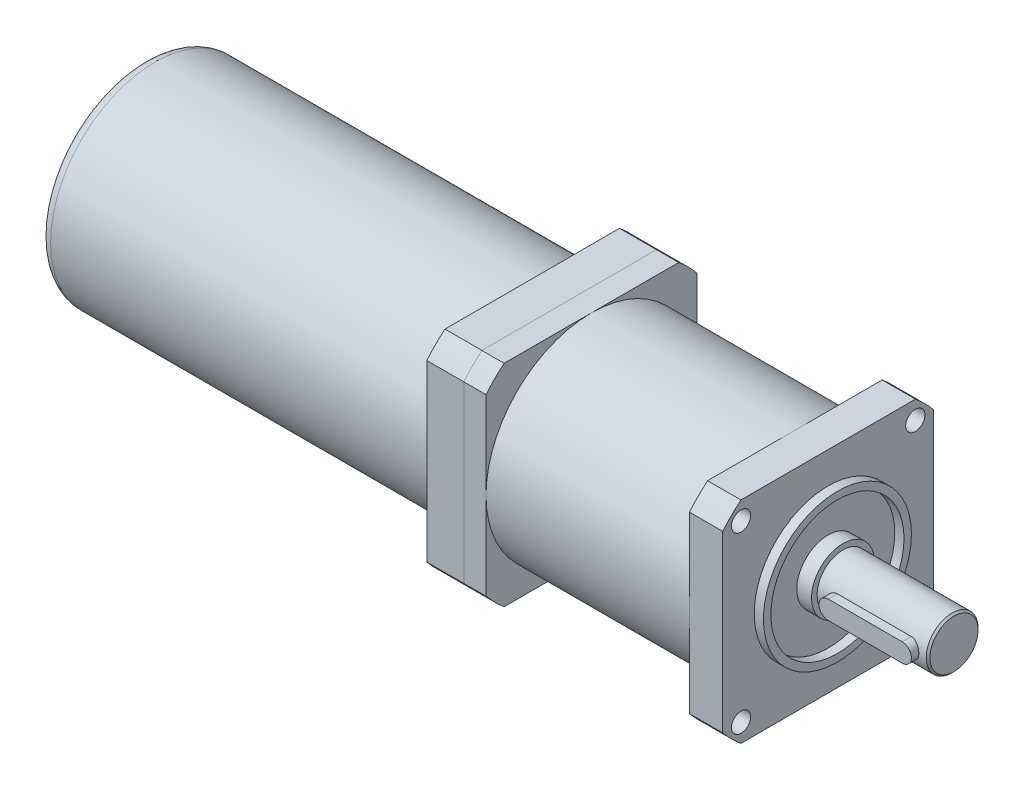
ISO-10303-21;
HEADER;
FILE_DESCRIPTION(('STEP AP214'),'2;1');
FILE_NAME('part.step','',(''),(''),'','','');
FILE_SCHEMA(('AUTOMOTIVE_DESIGN { 1 0 10303 214 1 1 1 1 }'));
ENDSEC;
DATA;
#1=APPLICATION_CONTEXT('core data for automotive mechanical design processes');
#2=APPLICATION_PROTOCOL_DEFINITION('international standard','automotive_design',2000,#1);
#3=PRODUCT_CONTEXT('',#1,'mechanical');
#4=PRODUCT('Part','Part','',(#3));
#5=PRODUCT_RELATED_PRODUCT_CATEGORY('part','',(#4));
#6=PRODUCT_DEFINITION_FORMATION('','',#4);
#7=PRODUCT_DEFINITION_CONTEXT('part definition',#1,'design');
#8=PRODUCT_DEFINITION('design','',#6,#7);
#9=PRODUCT_DEFINITION_SHAPE('','',#8);
#10=(LENGTH_UNIT() NAMED_UNIT(*) SI_UNIT(.MILLI.,.METRE.));
#11=(NAMED_UNIT(*) PLANE_ANGLE_UNIT() SI_UNIT($,.RADIAN.));
#12=(NAMED_UNIT(*) SI_UNIT($,.STERADIAN.) SOLID_ANGLE_UNIT());
#13=UNCERTAINTY_MEASURE_WITH_UNIT(LENGTH_MEASURE(1.E-05),#10,'distance_accuracy_value','');
#14=(GEOMETRIC_REPRESENTATION_CONTEXT(3) GLOBAL_UNCERTAINTY_ASSIGNED_CONTEXT((#13)) GLOBAL_UNIT_ASSIGNED_CONTEXT((#10,
#11,#12)) REPRESENTATION_CONTEXT('',''));
#15=CARTESIAN_POINT('',(0.,0.,0.));
#16=DIRECTION('',(0.,0.,1.));
#17=DIRECTION('',(1.,0.,0.));
#18=AXIS2_PLACEMENT_3D('',#15,#16,#17);
#19=CARTESIAN_POINT('',(-80.,0.,0.));
#20=DIRECTION('',(-1.,0.,0.));
#21=DIRECTION('',(0.,0.,1.));
#22=AXIS2_PLACEMENT_3D('',#19,#20,#21);
#23=PLANE('',#22);
#24=CARTESIAN_POINT('',(-80.,0.,0.));
#25=DIRECTION('',(-1.,0.,0.));
#26=DIRECTION('',(0.,0.,1.));
#27=AXIS2_PLACEMENT_3D('',#24,#25,#26);
#28=CIRCLE('',#27,37.);
#29=CARTESIAN_POINT('',(-80.,28.5,-23.5955504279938));
#30=VERTEX_POINT('',#29);
#31=CARTESIAN_POINT('',(-80.,23.5955504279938,-28.5));
#32=VERTEX_POINT('',#31);
#33=EDGE_CURVE('E158',#30,#32,#28,.T.);
#34=ORIENTED_EDGE('',*,*,#33,.T.);
#35=DIRECTION('',(0.,-1.,0.));
#36=VECTOR('',#35,1.);
#37=CARTESIAN_POINT('',(-80.,-23.5955504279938,-28.5));
#38=LINE('',#37,#36);
#39=CARTESIAN_POINT('',(-80.,-23.5955504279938,-28.5));
#40=VERTEX_POINT('',#39);
#41=EDGE_CURVE('E106',#32,#40,#38,.T.);
#42=ORIENTED_EDGE('',*,*,#41,.T.);
#43=CARTESIAN_POINT('',(-80.,0.,0.));
#44=DIRECTION('',(-1.,0.,0.));
#45=DIRECTION('',(0.,0.,1.));
#46=AXIS2_PLACEMENT_3D('',#43,#44,#45);
#47=CIRCLE('',#46,37.);
#48=CARTESIAN_POINT('',(-80.,-28.5,-23.5955504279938));
#49=VERTEX_POINT('',#48);
#50=EDGE_CURVE('E226',#40,#49,#47,.T.);
#51=ORIENTED_EDGE('',*,*,#50,.T.);
#52=DIRECTION('',(0.,0.,1.));
#53=VECTOR('',#52,1.);
#54=CARTESIAN_POINT('',(-80.,-28.5,-23.5955504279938));
#55=LINE('',#54,#53);
#56=CARTESIAN_POINT('',(-80.,-28.5,23.5955504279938));
#57=VERTEX_POINT('',#56);
#58=EDGE_CURVE('E231',#49,#57,#55,.T.);
#59=ORIENTED_EDGE('',*,*,#58,.T.);
#60=CARTESIAN_POINT('',(-80.,0.,0.));
#61=DIRECTION('',(-1.,0.,0.));
#62=DIRECTION('',(0.,0.,1.));
#63=AXIS2_PLACEMENT_3D('',#60,#61,#62);
#64=CIRCLE('',#63,37.);
#65=CARTESIAN_POINT('',(-80.,-23.5955504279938,28.5));
#66=VERTEX_POINT('',#65);
#67=EDGE_CURVE('E125',#57,#66,#64,.T.);
#68=ORIENTED_EDGE('',*,*,#67,.T.);
#69=DIRECTION('',(0.,1.,0.));
#70=VECTOR('',#69,1.);
#71=CARTESIAN_POINT('',(-80.,-23.5955504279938,28.5));
#72=LINE('',#71,#70);
#73=CARTESIAN_POINT('',(-80.,23.5955504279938,28.5));
#74=VERTEX_POINT('',#73);
#75=EDGE_CURVE('E119',#66,#74,#72,.T.);
#76=ORIENTED_EDGE('',*,*,#75,.T.);
#77=CARTESIAN_POINT('',(-80.,0.,0.));
#78=DIRECTION('',(-1.,0.,0.));
#79=DIRECTION('',(0.,0.,1.));
#80=AXIS2_PLACEMENT_3D('',#77,#78,#79);
#81=CIRCLE('',#80,37.);
#82=CARTESIAN_POINT('',(-80.,28.5,23.5955504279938));
#83=VERTEX_POINT('',#82);
#84=EDGE_CURVE('E123',#74,#83,#81,.T.);
#85=ORIENTED_EDGE('',*,*,#84,.T.);
#86=DIRECTION('',(0.,0.,-1.));
#87=VECTOR('',#86,1.);
#88=CARTESIAN_POINT('',(-80.,28.5,-23.5955504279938));
#89=LINE('',#88,#87);
#90=EDGE_CURVE('E62',#83,#30,#89,.T.);
#91=ORIENTED_EDGE('',*,*,#90,.T.);
#92=EDGE_LOOP('',(#34,#42,#51,#59,#68,#76,#85,#91));
#93=FACE_BOUND('',#92,.T.);
#94=CARTESIAN_POINT('',(-80.,0.,0.));
#95=DIRECTION('',(-1.,0.,0.));
#96=DIRECTION('',(0.,0.,1.));
#97=AXIS2_PLACEMENT_3D('',#94,#95,#96);
#98=CIRCLE('',#97,28.2);
#99=CARTESIAN_POINT('',(-80.,0.,28.2));
#100=VERTEX_POINT('',#99);
#101=EDGE_CURVE('E147',#100,#100,#98,.T.);
#102=ORIENTED_EDGE('',*,*,#101,.F.);
#103=EDGE_LOOP('',(#102));
#104=FACE_BOUND('',#103,.T.);
#105=ADVANCED_FACE('F45',(#93,#104),#23,.T.);
#106=CARTESIAN_POINT('',(-80.,0.,0.));
#107=DIRECTION('',(1.,0.,0.));
#108=DIRECTION('',(0.,0.,-1.));
#109=AXIS2_PLACEMENT_3D('',#106,#107,#108);
#110=CYLINDRICAL_SURFACE('',#109,37.);
#111=CARTESIAN_POINT('',(-70.,0.,0.));
#112=DIRECTION('',(-1.,0.,0.));
#113=DIRECTION('',(0.,0.,1.));
#114=AXIS2_PLACEMENT_3D('',#111,#112,#113);
#115=CIRCLE('',#114,37.);
#116=CARTESIAN_POINT('',(-70.,28.5,-23.5955504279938));
#117=VERTEX_POINT('',#116);
#118=CARTESIAN_POINT('',(-70.,23.5955504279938,-28.5));
#119=VERTEX_POINT('',#118);
#120=EDGE_CURVE('E143',#117,#119,#115,.T.);
#121=ORIENTED_EDGE('',*,*,#120,.T.);
#122=DIRECTION('',(1.,0.,0.));
#123=VECTOR('',#122,1.);
#124=CARTESIAN_POINT('',(-80.,23.5955504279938,-28.5));
#125=LINE('',#124,#123);
#126=EDGE_CURVE('E171',#32,#119,#125,.T.);
#127=ORIENTED_EDGE('',*,*,#126,.F.);
#128=ORIENTED_EDGE('',*,*,#33,.F.);
#129=DIRECTION('',(1.,0.,0.));
#130=VECTOR('',#129,1.);
#131=CARTESIAN_POINT('',(-80.,28.5,-23.5955504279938));
#132=LINE('',#131,#130);
#133=EDGE_CURVE('E139',#30,#117,#132,.T.);
#134=ORIENTED_EDGE('',*,*,#133,.T.);
#135=EDGE_LOOP('',(#121,#127,#128,#134));
#136=FACE_BOUND('',#135,.T.);
#137=ADVANCED_FACE('F186',(#136),#110,.T.);
#138=CARTESIAN_POINT('',(-80.,-23.5955504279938,-28.5));
#139=DIRECTION('',(0.,0.,1.));
#140=DIRECTION('',(1.,0.,0.));
#141=AXIS2_PLACEMENT_3D('',#138,#139,#140);
#142=PLANE('',#141);
#143=DIRECTION('',(0.,-1.,0.));
#144=VECTOR('',#143,1.);
#145=CARTESIAN_POINT('',(-70.,-23.5955504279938,-28.5));
#146=LINE('',#145,#144);
#147=CARTESIAN_POINT('',(-70.,-23.5955504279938,-28.5));
#148=VERTEX_POINT('',#147);
#149=EDGE_CURVE('E146',#119,#148,#146,.T.);
#150=ORIENTED_EDGE('',*,*,#149,.T.);
#151=DIRECTION('',(1.,0.,0.));
#152=VECTOR('',#151,1.);
#153=CARTESIAN_POINT('',(-80.,-23.5955504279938,-28.5));
#154=LINE('',#153,#152);
#155=EDGE_CURVE('E168',#40,#148,#154,.T.);
#156=ORIENTED_EDGE('',*,*,#155,.F.);
#157=ORIENTED_EDGE('',*,*,#41,.F.);
#158=ORIENTED_EDGE('',*,*,#126,.T.);
#159=EDGE_LOOP('',(#150,#156,#157,#158));
#160=FACE_BOUND('',#159,.T.);
#161=ADVANCED_FACE('F191',(#160),#142,.F.);
#162=CARTESIAN_POINT('',(-80.,0.,0.));
#163=DIRECTION('',(1.,0.,0.));
#164=DIRECTION('',(0.,0.,-1.));
#165=AXIS2_PLACEMENT_3D('',#162,#163,#164);
#166=CYLINDRICAL_SURFACE('',#165,37.);
#167=CARTESIAN_POINT('',(-70.,0.,0.));
#168=DIRECTION('',(-1.,0.,0.));
#169=DIRECTION('',(0.,0.,1.));
#170=AXIS2_PLACEMENT_3D('',#167,#168,#169);
#171=CIRCLE('',#170,37.);
#172=CARTESIAN_POINT('',(-70.,-28.5,-23.5955504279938));
#173=VERTEX_POINT('',#172);
#174=EDGE_CURVE('E149',#148,#173,#171,.T.);
#175=ORIENTED_EDGE('',*,*,#174,.T.);
#176=DIRECTION('',(1.,0.,0.));
#177=VECTOR('',#176,1.);
#178=CARTESIAN_POINT('',(-80.,-28.5,-23.5955504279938));
#179=LINE('',#178,#177);
#180=EDGE_CURVE('E165',#49,#173,#179,.T.);
#181=ORIENTED_EDGE('',*,*,#180,.F.);
#182=ORIENTED_EDGE('',*,*,#50,.F.);
#183=ORIENTED_EDGE('',*,*,#155,.T.);
#184=EDGE_LOOP('',(#175,#181,#182,#183));
#185=FACE_BOUND('',#184,.T.);
#186=ADVANCED_FACE('F213',(#185),#166,.T.);
#187=CARTESIAN_POINT('',(-80.,-28.5,-23.5955504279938));
#188=DIRECTION('',(0.,1.,0.));
#189=DIRECTION('',(0.,0.,1.));
#190=AXIS2_PLACEMENT_3D('',#187,#188,#189);
#191=PLANE('',#190);
#192=DIRECTION('',(0.,0.,1.));
#193=VECTOR('',#192,1.);
#194=CARTESIAN_POINT('',(-70.,-28.5,-23.5955504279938));
#195=LINE('',#194,#193);
#196=CARTESIAN_POINT('',(-70.,-28.5,23.5955504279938));
#197=VERTEX_POINT('',#196);
#198=EDGE_CURVE('E151',#173,#197,#195,.T.);
#199=ORIENTED_EDGE('',*,*,#198,.T.);
#200=DIRECTION('',(1.,0.,0.));
#201=VECTOR('',#200,1.);
#202=CARTESIAN_POINT('',(-80.,-28.5,23.5955504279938));
#203=LINE('',#202,#201);
#204=EDGE_CURVE('E162',#57,#197,#203,.T.);
#205=ORIENTED_EDGE('',*,*,#204,.F.);
#206=ORIENTED_EDGE('',*,*,#58,.F.);
#207=ORIENTED_EDGE('',*,*,#180,.T.);
#208=EDGE_LOOP('',(#199,#205,#206,#207));
#209=FACE_BOUND('',#208,.T.);
#210=ADVANCED_FACE('F209',(#209),#191,.F.);
#211=CARTESIAN_POINT('',(-80.,0.,0.));
#212=DIRECTION('',(1.,0.,0.));
#213=DIRECTION('',(0.,0.,-1.));
#214=AXIS2_PLACEMENT_3D('',#211,#212,#213);
#215=CYLINDRICAL_SURFACE('',#214,37.);
#216=CARTESIAN_POINT('',(-70.,0.,0.));
#217=DIRECTION('',(-1.,0.,0.));
#218=DIRECTION('',(0.,0.,1.));
#219=AXIS2_PLACEMENT_3D('',#216,#217,#218);
#220=CIRCLE('',#219,37.);
#221=CARTESIAN_POINT('',(-70.,-23.5955504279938,28.5));
#222=VERTEX_POINT('',#221);
#223=EDGE_CURVE('E153',#197,#222,#220,.T.);
#224=ORIENTED_EDGE('',*,*,#223,.T.);
#225=DIRECTION('',(1.,0.,0.));
#226=VECTOR('',#225,1.);
#227=CARTESIAN_POINT('',(-80.,-23.5955504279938,28.5));
#228=LINE('',#227,#226);
#229=EDGE_CURVE('E134',#66,#222,#228,.T.);
#230=ORIENTED_EDGE('',*,*,#229,.F.);
#231=ORIENTED_EDGE('',*,*,#67,.F.);
#232=ORIENTED_EDGE('',*,*,#204,.T.);
#233=EDGE_LOOP('',(#224,#230,#231,#232));
#234=FACE_BOUND('',#233,.T.);
#235=ADVANCED_FACE('F206',(#234),#215,.T.);
#236=CARTESIAN_POINT('',(-80.,-23.5955504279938,28.5));
#237=DIRECTION('',(0.,0.,-1.));
#238=DIRECTION('',(-1.,0.,0.));
#239=AXIS2_PLACEMENT_3D('',#236,#237,#238);
#240=PLANE('',#239);
#241=DIRECTION('',(0.,1.,0.));
#242=VECTOR('',#241,1.);
#243=CARTESIAN_POINT('',(-70.,-23.5955504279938,28.5));
#244=LINE('',#243,#242);
#245=CARTESIAN_POINT('',(-70.,23.5955504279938,28.5));
#246=VERTEX_POINT('',#245);
#247=EDGE_CURVE('E133',#222,#246,#244,.T.);
#248=ORIENTED_EDGE('',*,*,#247,.T.);
#249=DIRECTION('',(1.,0.,0.));
#250=VECTOR('',#249,1.);
#251=CARTESIAN_POINT('',(-80.,23.5955504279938,28.5));
#252=LINE('',#251,#250);
#253=EDGE_CURVE('E130',#74,#246,#252,.T.);
#254=ORIENTED_EDGE('',*,*,#253,.F.);
#255=ORIENTED_EDGE('',*,*,#75,.F.);
#256=ORIENTED_EDGE('',*,*,#229,.T.);
#257=EDGE_LOOP('',(#248,#254,#255,#256));
#258=FACE_BOUND('',#257,.T.);
#259=ADVANCED_FACE('F131',(#258),#240,.F.);
#260=CARTESIAN_POINT('',(-80.,0.,0.));
#261=DIRECTION('',(1.,0.,0.));
#262=DIRECTION('',(0.,0.,-1.));
#263=AXIS2_PLACEMENT_3D('',#260,#261,#262);
#264=CYLINDRICAL_SURFACE('',#263,37.);
#265=CARTESIAN_POINT('',(-70.,0.,0.));
#266=DIRECTION('',(-1.,0.,0.));
#267=DIRECTION('',(0.,0.,1.));
#268=AXIS2_PLACEMENT_3D('',#265,#266,#267);
#269=CIRCLE('',#268,37.);
#270=CARTESIAN_POINT('',(-70.,28.5,23.5955504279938));
#271=VERTEX_POINT('',#270);
#272=EDGE_CURVE('E91',#246,#271,#269,.T.);
#273=ORIENTED_EDGE('',*,*,#272,.T.);
#274=DIRECTION('',(1.,0.,0.));
#275=VECTOR('',#274,1.);
#276=CARTESIAN_POINT('',(-80.,28.5,23.5955504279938));
#277=LINE('',#276,#275);
#278=EDGE_CURVE('E135',#83,#271,#277,.T.);
#279=ORIENTED_EDGE('',*,*,#278,.F.);
#280=ORIENTED_EDGE('',*,*,#84,.F.);
#281=ORIENTED_EDGE('',*,*,#253,.T.);
#282=EDGE_LOOP('',(#273,#279,#280,#281));
#283=FACE_BOUND('',#282,.T.);
#284=ADVANCED_FACE('F137',(#283),#264,.T.);
#285=CARTESIAN_POINT('',(-80.,28.5,-23.5955504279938));
#286=DIRECTION('',(0.,-1.,0.));
#287=DIRECTION('',(0.,0.,-1.));
#288=AXIS2_PLACEMENT_3D('',#285,#286,#287);
#289=PLANE('',#288);
#290=DIRECTION('',(0.,0.,-1.));
#291=VECTOR('',#290,1.);
#292=CARTESIAN_POINT('',(-70.,28.5,-23.5955504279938));
#293=LINE('',#292,#291);
#294=EDGE_CURVE('E97',#271,#117,#293,.T.);
#295=ORIENTED_EDGE('',*,*,#294,.T.);
#296=ORIENTED_EDGE('',*,*,#133,.F.);
#297=ORIENTED_EDGE('',*,*,#90,.F.);
#298=ORIENTED_EDGE('',*,*,#278,.T.);
#299=EDGE_LOOP('',(#295,#296,#297,#298));
#300=FACE_BOUND('',#299,.T.);
#301=ADVANCED_FACE('F198',(#300),#289,.F.);
#302=CARTESIAN_POINT('',(-70.,0.,0.));
#303=DIRECTION('',(-1.,0.,0.));
#304=DIRECTION('',(0.,0.,1.));
#305=AXIS2_PLACEMENT_3D('',#302,#303,#304);
#306=PLANE('',#305);
#307=ORIENTED_EDGE('',*,*,#120,.F.);
#308=ORIENTED_EDGE('',*,*,#294,.F.);
#309=ORIENTED_EDGE('',*,*,#272,.F.);
#310=ORIENTED_EDGE('',*,*,#247,.F.);
#311=ORIENTED_EDGE('',*,*,#223,.F.);
#312=ORIENTED_EDGE('',*,*,#198,.F.);
#313=ORIENTED_EDGE('',*,*,#174,.F.);
#314=ORIENTED_EDGE('',*,*,#149,.F.);
#315=EDGE_LOOP('',(#307,#308,#309,#310,#311,#312,#313,#314));
#316=FACE_BOUND('',#315,.T.);
#317=ADVANCED_FACE('F195',(#316),#306,.F.);
#318=CARTESIAN_POINT('',(-185.,0.,0.));
#319=DIRECTION('',(1.,0.,0.));
#320=DIRECTION('',(0.,0.,-1.));
#321=AXIS2_PLACEMENT_3D('',#318,#319,#320);
#322=CYLINDRICAL_SURFACE('',#321,28.2);
#323=CARTESIAN_POINT('',(-182.,0.,0.));
#324=DIRECTION('',(-1.,0.,0.));
#325=DIRECTION('',(0.,0.,1.));
#326=AXIS2_PLACEMENT_3D('',#323,#324,#325);
#327=CIRCLE('',#326,28.2);
#328=CARTESIAN_POINT('',(-182.,0.,28.2));
#329=VERTEX_POINT('',#328);
#330=EDGE_CURVE('E12',#329,#329,#327,.F.);
#331=ORIENTED_EDGE('',*,*,#330,.T.);
#332=EDGE_LOOP('',(#331));
#333=FACE_BOUND('',#332,.T.);
#334=ORIENTED_EDGE('',*,*,#101,.T.);
#335=EDGE_LOOP('',(#334));
#336=FACE_BOUND('',#335,.T.);
#337=ADVANCED_FACE('F182',(#333,#336),#322,.T.);
#338=CARTESIAN_POINT('',(-185.,0.,0.));
#339=DIRECTION('',(-1.,0.,0.));
#340=DIRECTION('',(0.,0.,1.));
#341=AXIS2_PLACEMENT_3D('',#338,#339,#340);
#342=PLANE('',#341);
#343=CARTESIAN_POINT('',(-185.,0.,0.));
#344=DIRECTION('',(-1.,0.,0.));
#345=DIRECTION('',(0.,0.,1.));
#346=AXIS2_PLACEMENT_3D('',#343,#344,#345);
#347=CIRCLE('',#346,25.2);
#348=CARTESIAN_POINT('',(-185.,0.,25.2));
#349=VERTEX_POINT('',#348);
#350=EDGE_CURVE('E54',#349,#349,#347,.T.);
#351=ORIENTED_EDGE('',*,*,#350,.T.);
#352=EDGE_LOOP('',(#351));
#353=FACE_BOUND('',#352,.T.);
#354=ADVANCED_FACE('F175',(#353),#342,.T.);
#355=CARTESIAN_POINT('',(-182.,0.,0.));
#356=DIRECTION('',(-1.,0.,0.));
#357=DIRECTION('',(0.,0.,1.));
#358=AXIS2_PLACEMENT_3D('',#355,#356,#357);
#359=TOROIDAL_SURFACE('',#358,25.2,3.);
#360=ORIENTED_EDGE('',*,*,#330,.F.);
#361=EDGE_LOOP('',(#360));
#362=FACE_BOUND('',#361,.T.);
#363=ORIENTED_EDGE('',*,*,#350,.F.);
#364=EDGE_LOOP('',(#363));
#365=FACE_BOUND('',#364,.T.);
#366=ADVANCED_FACE('F47',(#362,#365),#359,.T.);
#367=CLOSED_SHELL('',(#105,#137,#161,#186,#210,#235,#259,#284,#301,#317,#337,#354,#366));
#368=MANIFOLD_SOLID_BREP('B2',#367);
#369=CARTESIAN_POINT('',(4.,0.,0.));
#370=DIRECTION('',(1.,0.,0.));
#371=DIRECTION('',(0.,0.,-1.));
#372=AXIS2_PLACEMENT_3D('',#369,#370,#371);
#373=PLANE('',#372);
#374=CARTESIAN_POINT('',(4.,0.,0.));
#375=DIRECTION('',(1.,0.,0.));
#376=DIRECTION('',(0.,0.,-1.));
#377=AXIS2_PLACEMENT_3D('',#374,#375,#376);
#378=CIRCLE('',#377,8.5);
#379=CARTESIAN_POINT('',(4.,0.,-8.5));
#380=VERTEX_POINT('',#379);
#381=EDGE_CURVE('E510',#380,#380,#378,.T.);
#382=ORIENTED_EDGE('',*,*,#381,.T.);
#383=EDGE_LOOP('',(#382));
#384=FACE_BOUND('',#383,.T.);
#385=CARTESIAN_POINT('',(4.,0.,0.));
#386=DIRECTION('',(1.,0.,0.));
#387=DIRECTION('',(0.,0.,-1.));
#388=AXIS2_PLACEMENT_3D('',#385,#386,#387);
#389=CIRCLE('',#388,7.);
#390=CARTESIAN_POINT('',(4.,0.,-7.));
#391=VERTEX_POINT('',#390);
#392=EDGE_CURVE('E501',#391,#391,#389,.T.);
#393=ORIENTED_EDGE('',*,*,#392,.F.);
#394=EDGE_LOOP('',(#393));
#395=FACE_BOUND('',#394,.T.);
#396=ADVANCED_FACE('F318',(#384,#395),#373,.T.);
#397=CARTESIAN_POINT('',(0.,0.,0.));
#398=DIRECTION('',(1.,0.,0.));
#399=DIRECTION('',(0.,0.,-1.));
#400=AXIS2_PLACEMENT_3D('',#397,#398,#399);
#401=PLANE('',#400);
#402=CARTESIAN_POINT('',(0.,0.,0.));
#403=DIRECTION('',(1.,0.,0.));
#404=DIRECTION('',(0.,0.,-1.));
#405=AXIS2_PLACEMENT_3D('',#402,#403,#404);
#406=CIRCLE('',#405,18.);
#407=CARTESIAN_POINT('',(0.,0.,-18.));
#408=VERTEX_POINT('',#407);
#409=EDGE_CURVE('E690',#408,#408,#406,.F.);
#410=ORIENTED_EDGE('',*,*,#409,.F.);
#411=EDGE_LOOP('',(#410));
#412=FACE_BOUND('',#411,.T.);
#413=CARTESIAN_POINT('',(0.,0.,0.));
#414=DIRECTION('',(1.,0.,0.));
#415=DIRECTION('',(0.,0.,-1.));
#416=AXIS2_PLACEMENT_3D('',#413,#414,#415);
#417=CIRCLE('',#416,8.5);
#418=CARTESIAN_POINT('',(0.,0.,-8.5));
#419=VERTEX_POINT('',#418);
#420=EDGE_CURVE('E504',#419,#419,#417,.T.);
#421=ORIENTED_EDGE('',*,*,#420,.F.);
#422=EDGE_LOOP('',(#421));
#423=FACE_BOUND('',#422,.T.);
#424=ADVANCED_FACE('F725',(#412,#423),#401,.T.);
#425=CARTESIAN_POINT('',(0.,-23.55,23.55));
#426=DIRECTION('',(1.,0.,0.));
#427=DIRECTION('',(0.,0.,-1.));
#428=AXIS2_PLACEMENT_3D('',#425,#426,#427);
#429=CIRCLE('',#428,2.6);
#430=CARTESIAN_POINT('',(0.,-23.55,20.95));
#431=VERTEX_POINT('',#430);
#432=EDGE_CURVE('E522',#431,#431,#429,.T.);
#433=ORIENTED_EDGE('',*,*,#432,.F.);
#434=EDGE_LOOP('',(#433));
#435=FACE_BOUND('',#434,.T.);
#436=CARTESIAN_POINT('',(0.,-23.55,-23.55));
#437=DIRECTION('',(1.,0.,0.));
#438=DIRECTION('',(0.,0.,-1.));
#439=AXIS2_PLACEMENT_3D('',#436,#437,#438);
#440=CIRCLE('',#439,2.6);
#441=CARTESIAN_POINT('',(0.,-23.55,-26.15));
#442=VERTEX_POINT('',#441);
#443=EDGE_CURVE('E528',#442,#442,#440,.T.);
#444=ORIENTED_EDGE('',*,*,#443,.F.);
#445=EDGE_LOOP('',(#444));
#446=FACE_BOUND('',#445,.T.);
#447=CARTESIAN_POINT('',(0.,23.55,-23.55));
#448=DIRECTION('',(1.,0.,0.));
#449=DIRECTION('',(0.,0.,-1.));
#450=AXIS2_PLACEMENT_3D('',#447,#448,#449);
#451=CIRCLE('',#450,2.6);
#452=CARTESIAN_POINT('',(0.,23.55,-26.15));
#453=VERTEX_POINT('',#452);
#454=EDGE_CURVE('E534',#453,#453,#451,.T.);
#455=ORIENTED_EDGE('',*,*,#454,.F.);
#456=EDGE_LOOP('',(#455));
#457=FACE_BOUND('',#456,.T.);
#458=CARTESIAN_POINT('',(0.,23.55,23.55));
#459=DIRECTION('',(1.,0.,0.));
#460=DIRECTION('',(0.,0.,-1.));
#461=AXIS2_PLACEMENT_3D('',#458,#459,#460);
#462=CIRCLE('',#461,2.6);
#463=CARTESIAN_POINT('',(0.,23.55,20.95));
#464=VERTEX_POINT('',#463);
#465=EDGE_CURVE('E540',#464,#464,#462,.T.);
#466=ORIENTED_EDGE('',*,*,#465,.F.);
#467=EDGE_LOOP('',(#466));
#468=FACE_BOUND('',#467,.T.);
#469=CARTESIAN_POINT('',(0.,0.,0.));
#470=DIRECTION('',(1.,0.,0.));
#471=DIRECTION('',(0.,0.,-1.));
#472=AXIS2_PLACEMENT_3D('',#469,#470,#471);
#473=CIRCLE('',#472,37.);
#474=CARTESIAN_POINT('',(0.,23.5955504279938,-28.5));
#475=VERTEX_POINT('',#474);
#476=CARTESIAN_POINT('',(0.,28.5,-23.5955504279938));
#477=VERTEX_POINT('',#476);
#478=EDGE_CURVE('E618',#475,#477,#473,.T.);
#479=ORIENTED_EDGE('',*,*,#478,.T.);
#480=DIRECTION('',(0.,0.,1.));
#481=VECTOR('',#480,1.);
#482=CARTESIAN_POINT('',(0.,28.5,23.5955504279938));
#483=LINE('',#482,#481);
#484=CARTESIAN_POINT('',(0.,28.5,23.5955504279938));
#485=VERTEX_POINT('',#484);
#486=EDGE_CURVE('E655',#477,#485,#483,.T.);
#487=ORIENTED_EDGE('',*,*,#486,.T.);
#488=CARTESIAN_POINT('',(0.,0.,0.));
#489=DIRECTION('',(1.,0.,0.));
#490=DIRECTION('',(0.,0.,-1.));
#491=AXIS2_PLACEMENT_3D('',#488,#489,#490);
#492=CIRCLE('',#491,37.);
#493=CARTESIAN_POINT('',(0.,23.5955504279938,28.5));
#494=VERTEX_POINT('',#493);
#495=EDGE_CURVE('E658',#485,#494,#492,.T.);
#496=ORIENTED_EDGE('',*,*,#495,.T.);
#497=DIRECTION('',(0.,-1.,0.));
#498=VECTOR('',#497,1.);
#499=CARTESIAN_POINT('',(0.,-23.5955504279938,28.5));
#500=LINE('',#499,#498);
#501=CARTESIAN_POINT('',(0.,-23.5955504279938,28.5));
#502=VERTEX_POINT('',#501);
#503=EDGE_CURVE('E661',#494,#502,#500,.T.);
#504=ORIENTED_EDGE('',*,*,#503,.T.);
#505=CARTESIAN_POINT('',(0.,0.,0.));
#506=DIRECTION('',(1.,0.,0.));
#507=DIRECTION('',(0.,0.,-1.));
#508=AXIS2_PLACEMENT_3D('',#505,#506,#507);
#509=CIRCLE('',#508,37.);
#510=CARTESIAN_POINT('',(0.,-28.5,23.5955504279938));
#511=VERTEX_POINT('',#510);
#512=EDGE_CURVE('E664',#502,#511,#509,.T.);
#513=ORIENTED_EDGE('',*,*,#512,.T.);
#514=DIRECTION('',(0.,0.,-1.));
#515=VECTOR('',#514,1.);
#516=CARTESIAN_POINT('',(0.,-28.5,23.5955504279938));
#517=LINE('',#516,#515);
#518=CARTESIAN_POINT('',(0.,-28.5,-23.5955504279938));
#519=VERTEX_POINT('',#518);
#520=EDGE_CURVE('E667',#511,#519,#517,.T.);
#521=ORIENTED_EDGE('',*,*,#520,.T.);
#522=CARTESIAN_POINT('',(0.,0.,0.));
#523=DIRECTION('',(1.,0.,0.));
#524=DIRECTION('',(0.,0.,-1.));
#525=AXIS2_PLACEMENT_3D('',#522,#523,#524);
#526=CIRCLE('',#525,37.);
#527=CARTESIAN_POINT('',(0.,-23.5955504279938,-28.5));
#528=VERTEX_POINT('',#527);
#529=EDGE_CURVE('E670',#519,#528,#526,.T.);
#530=ORIENTED_EDGE('',*,*,#529,.T.);
#531=DIRECTION('',(0.,1.,0.));
#532=VECTOR('',#531,1.);
#533=CARTESIAN_POINT('',(0.,-23.5955504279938,-28.5));
#534=LINE('',#533,#532);
#535=EDGE_CURVE('E628',#528,#475,#534,.T.);
#536=ORIENTED_EDGE('',*,*,#535,.T.);
#537=EDGE_LOOP('',(#479,#487,#496,#504,#513,#521,#530,#536));
#538=FACE_BOUND('',#537,.T.);
#539=CARTESIAN_POINT('',(0.,0.,0.));
#540=DIRECTION('',(1.,0.,0.));
#541=DIRECTION('',(0.,0.,-1.));
#542=AXIS2_PLACEMENT_3D('',#539,#540,#541);
#543=CIRCLE('',#542,20.);
#544=CARTESIAN_POINT('',(0.,0.,-20.));
#545=VERTEX_POINT('',#544);
#546=EDGE_CURVE('E518',#545,#545,#543,.T.);
#547=ORIENTED_EDGE('',*,*,#546,.F.);
#548=EDGE_LOOP('',(#547));
#549=FACE_BOUND('',#548,.T.);
#550=ADVANCED_FACE('F730',(#435,#446,#457,#468,#538,#549),#401,.T.);
#551=CARTESIAN_POINT('',(-9.,0.,0.));
#552=DIRECTION('',(1.,0.,0.));
#553=DIRECTION('',(0.,0.,-1.));
#554=AXIS2_PLACEMENT_3D('',#551,#552,#553);
#555=PLANE('',#554);
#556=CARTESIAN_POINT('',(-9.,23.55,23.55));
#557=DIRECTION('',(1.,0.,0.));
#558=DIRECTION('',(0.,0.,-1.));
#559=AXIS2_PLACEMENT_3D('',#556,#557,#558);
#560=CIRCLE('',#559,2.6);
#561=CARTESIAN_POINT('',(-9.,23.55,20.95));
#562=VERTEX_POINT('',#561);
#563=EDGE_CURVE('E543',#562,#562,#560,.T.);
#564=ORIENTED_EDGE('',*,*,#563,.T.);
#565=EDGE_LOOP('',(#564));
#566=FACE_BOUND('',#565,.T.);
#567=CARTESIAN_POINT('',(-9.,0.,0.));
#568=DIRECTION('',(-1.,0.,0.));
#569=DIRECTION('',(0.,0.,1.));
#570=AXIS2_PLACEMENT_3D('',#567,#568,#569);
#571=CIRCLE('',#570,28.5);
#572=CARTESIAN_POINT('',(-9.,0.,28.5));
#573=VERTEX_POINT('',#572);
#574=CARTESIAN_POINT('',(-9.,28.5,0.));
#575=VERTEX_POINT('',#574);
#576=EDGE_CURVE('E614',#573,#575,#571,.T.);
#577=ORIENTED_EDGE('',*,*,#576,.F.);
#578=DIRECTION('',(0.,-1.,0.));
#579=VECTOR('',#578,1.);
#580=CARTESIAN_POINT('',(-9.,-23.5955504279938,28.5));
#581=LINE('',#580,#579);
#582=CARTESIAN_POINT('',(-9.,23.5955504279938,28.5));
#583=VERTEX_POINT('',#582);
#584=EDGE_CURVE('E636',#583,#573,#581,.T.);
#585=ORIENTED_EDGE('',*,*,#584,.F.);
#586=CARTESIAN_POINT('',(-9.,0.,0.));
#587=DIRECTION('',(1.,0.,0.));
#588=DIRECTION('',(0.,0.,-1.));
#589=AXIS2_PLACEMENT_3D('',#586,#587,#588);
#590=CIRCLE('',#589,37.);
#591=CARTESIAN_POINT('',(-9.,28.5,23.5955504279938));
#592=VERTEX_POINT('',#591);
#593=EDGE_CURVE('E632',#592,#583,#590,.T.);
#594=ORIENTED_EDGE('',*,*,#593,.F.);
#595=DIRECTION('',(0.,0.,1.));
#596=VECTOR('',#595,1.);
#597=CARTESIAN_POINT('',(-9.,28.5,23.5955504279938));
#598=LINE('',#597,#596);
#599=EDGE_CURVE('E627',#575,#592,#598,.T.);
#600=ORIENTED_EDGE('',*,*,#599,.F.);
#601=EDGE_LOOP('',(#577,#585,#594,#600));
#602=FACE_BOUND('',#601,.T.);
#603=ADVANCED_FACE('F812',(#566,#602),#555,.F.);
#604=CARTESIAN_POINT('',(-9.,23.55,-23.55));
#605=DIRECTION('',(1.,0.,0.));
#606=DIRECTION('',(0.,0.,-1.));
#607=AXIS2_PLACEMENT_3D('',#604,#605,#606);
#608=CIRCLE('',#607,2.6);
#609=CARTESIAN_POINT('',(-9.,23.55,-26.15));
#610=VERTEX_POINT('',#609);
#611=EDGE_CURVE('E537',#610,#610,#608,.T.);
#612=ORIENTED_EDGE('',*,*,#611,.T.);
#613=EDGE_LOOP('',(#612));
#614=FACE_BOUND('',#613,.T.);
#615=CARTESIAN_POINT('',(-9.,0.,-28.5));
#616=VERTEX_POINT('',#615);
#617=EDGE_CURVE('E622',#575,#616,#571,.T.);
#618=ORIENTED_EDGE('',*,*,#617,.F.);
#619=CARTESIAN_POINT('',(-9.,28.5,-23.5955504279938));
#620=VERTEX_POINT('',#619);
#621=EDGE_CURVE('E629',#620,#575,#598,.T.);
#622=ORIENTED_EDGE('',*,*,#621,.F.);
#623=CARTESIAN_POINT('',(-9.,0.,0.));
#624=DIRECTION('',(1.,0.,0.));
#625=DIRECTION('',(0.,0.,-1.));
#626=AXIS2_PLACEMENT_3D('',#623,#624,#625);
#627=CIRCLE('',#626,37.);
#628=CARTESIAN_POINT('',(-9.,23.5955504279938,-28.5));
#629=VERTEX_POINT('',#628);
#630=EDGE_CURVE('E624',#629,#620,#627,.T.);
#631=ORIENTED_EDGE('',*,*,#630,.F.);
#632=DIRECTION('',(0.,1.,0.));
#633=VECTOR('',#632,1.);
#634=CARTESIAN_POINT('',(-9.,-23.5955504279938,-28.5));
#635=LINE('',#634,#633);
#636=EDGE_CURVE('E648',#616,#629,#635,.T.);
#637=ORIENTED_EDGE('',*,*,#636,.F.);
#638=EDGE_LOOP('',(#618,#622,#631,#637));
#639=FACE_BOUND('',#638,.T.);
#640=ADVANCED_FACE('F814',(#614,#639),#555,.F.);
#641=CARTESIAN_POINT('',(-9.,-23.55,-23.55));
#642=DIRECTION('',(1.,0.,0.));
#643=DIRECTION('',(0.,0.,-1.));
#644=AXIS2_PLACEMENT_3D('',#641,#642,#643);
#645=CIRCLE('',#644,2.6);
#646=CARTESIAN_POINT('',(-9.,-23.55,-26.15));
#647=VERTEX_POINT('',#646);
#648=EDGE_CURVE('E531',#647,#647,#645,.T.);
#649=ORIENTED_EDGE('',*,*,#648,.T.);
#650=EDGE_LOOP('',(#649));
#651=FACE_BOUND('',#650,.T.);
#652=CARTESIAN_POINT('',(-9.,-28.5,0.));
#653=VERTEX_POINT('',#652);
#654=EDGE_CURVE('E886',#616,#653,#571,.T.);
#655=ORIENTED_EDGE('',*,*,#654,.F.);
#656=CARTESIAN_POINT('',(-9.,-23.5955504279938,-28.5));
#657=VERTEX_POINT('',#656);
#658=EDGE_CURVE('E649',#657,#616,#635,.T.);
#659=ORIENTED_EDGE('',*,*,#658,.F.);
#660=CARTESIAN_POINT('',(-9.,0.,0.));
#661=DIRECTION('',(1.,0.,0.));
#662=DIRECTION('',(0.,0.,-1.));
#663=AXIS2_PLACEMENT_3D('',#660,#661,#662);
#664=CIRCLE('',#663,37.);
#665=CARTESIAN_POINT('',(-9.,-28.5,-23.5955504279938));
#666=VERTEX_POINT('',#665);
#667=EDGE_CURVE('E645',#666,#657,#664,.T.);
#668=ORIENTED_EDGE('',*,*,#667,.F.);
#669=DIRECTION('',(0.,0.,-1.));
#670=VECTOR('',#669,1.);
#671=CARTESIAN_POINT('',(-9.,-28.5,23.5955504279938));
#672=LINE('',#671,#670);
#673=EDGE_CURVE('E641',#653,#666,#672,.T.);
#674=ORIENTED_EDGE('',*,*,#673,.F.);
#675=EDGE_LOOP('',(#655,#659,#668,#674));
#676=FACE_BOUND('',#675,.T.);
#677=ADVANCED_FACE('F850',(#651,#676),#555,.F.);
#678=CARTESIAN_POINT('',(-9.,-23.55,23.55));
#679=DIRECTION('',(1.,0.,0.));
#680=DIRECTION('',(0.,0.,-1.));
#681=AXIS2_PLACEMENT_3D('',#678,#679,#680);
#682=CIRCLE('',#681,2.6);
#683=CARTESIAN_POINT('',(-9.,-23.55,20.95));
#684=VERTEX_POINT('',#683);
#685=EDGE_CURVE('E525',#684,#684,#682,.T.);
#686=ORIENTED_EDGE('',*,*,#685,.T.);
#687=EDGE_LOOP('',(#686));
#688=FACE_BOUND('',#687,.T.);
#689=EDGE_CURVE('E623',#653,#573,#571,.T.);
#690=ORIENTED_EDGE('',*,*,#689,.F.);
#691=CARTESIAN_POINT('',(-9.,-28.5,23.5955504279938));
#692=VERTEX_POINT('',#691);
#693=EDGE_CURVE('E642',#692,#653,#672,.T.);
#694=ORIENTED_EDGE('',*,*,#693,.F.);
#695=CARTESIAN_POINT('',(-9.,0.,0.));
#696=DIRECTION('',(1.,0.,0.));
#697=DIRECTION('',(0.,0.,-1.));
#698=AXIS2_PLACEMENT_3D('',#695,#696,#697);
#699=CIRCLE('',#698,37.);
#700=CARTESIAN_POINT('',(-9.,-23.5955504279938,28.5));
#701=VERTEX_POINT('',#700);
#702=EDGE_CURVE('E638',#701,#692,#699,.T.);
#703=ORIENTED_EDGE('',*,*,#702,.F.);
#704=EDGE_CURVE('E635',#573,#701,#581,.T.);
#705=ORIENTED_EDGE('',*,*,#704,.F.);
#706=EDGE_LOOP('',(#690,#694,#703,#705));
#707=FACE_BOUND('',#706,.T.);
#708=ADVANCED_FACE('F816',(#688,#707),#555,.F.);
#709=CARTESIAN_POINT('',(-9.,0.,0.));
#710=DIRECTION('',(1.,0.,0.));
#711=DIRECTION('',(0.,0.,-1.));
#712=AXIS2_PLACEMENT_3D('',#709,#710,#711);
#713=CYLINDRICAL_SURFACE('',#712,37.);
#714=ORIENTED_EDGE('',*,*,#478,.F.);
#715=DIRECTION('',(1.,0.,0.));
#716=VECTOR('',#715,1.);
#717=CARTESIAN_POINT('',(-9.,23.5955504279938,-28.5));
#718=LINE('',#717,#716);
#719=EDGE_CURVE('E675',#629,#475,#718,.T.);
#720=ORIENTED_EDGE('',*,*,#719,.F.);
#721=ORIENTED_EDGE('',*,*,#630,.T.);
#722=DIRECTION('',(1.,0.,0.));
#723=VECTOR('',#722,1.);
#724=CARTESIAN_POINT('',(-9.,28.5,-23.5955504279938));
#725=LINE('',#724,#723);
#726=EDGE_CURVE('E652',#620,#477,#725,.T.);
#727=ORIENTED_EDGE('',*,*,#726,.T.);
#728=EDGE_LOOP('',(#714,#720,#721,#727));
#729=FACE_BOUND('',#728,.T.);
#730=ADVANCED_FACE('F822',(#729),#713,.T.);
#731=CARTESIAN_POINT('',(-9.,-23.5955504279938,-28.5));
#732=DIRECTION('',(0.,0.,-1.));
#733=DIRECTION('',(-1.,0.,0.));
#734=AXIS2_PLACEMENT_3D('',#731,#732,#733);
#735=PLANE('',#734);
#736=ORIENTED_EDGE('',*,*,#535,.F.);
#737=DIRECTION('',(1.,0.,0.));
#738=VECTOR('',#737,1.);
#739=CARTESIAN_POINT('',(-9.,-23.5955504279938,-28.5));
#740=LINE('',#739,#738);
#741=EDGE_CURVE('E677',#657,#528,#740,.T.);
#742=ORIENTED_EDGE('',*,*,#741,.F.);
#743=ORIENTED_EDGE('',*,*,#658,.T.);
#744=ORIENTED_EDGE('',*,*,#636,.T.);
#745=ORIENTED_EDGE('',*,*,#719,.T.);
#746=EDGE_LOOP('',(#736,#742,#743,#744,#745));
#747=FACE_BOUND('',#746,.T.);
#748=ADVANCED_FACE('F818',(#747),#735,.T.);
#749=CARTESIAN_POINT('',(-9.,0.,0.));
#750=DIRECTION('',(1.,0.,0.));
#751=DIRECTION('',(0.,0.,-1.));
#752=AXIS2_PLACEMENT_3D('',#749,#750,#751);
#753=CYLINDRICAL_SURFACE('',#752,37.);
#754=ORIENTED_EDGE('',*,*,#529,.F.);
#755=DIRECTION('',(1.,0.,0.));
#756=VECTOR('',#755,1.);
#757=CARTESIAN_POINT('',(-9.,-28.5,-23.5955504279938));
#758=LINE('',#757,#756);
#759=EDGE_CURVE('E679',#666,#519,#758,.T.);
#760=ORIENTED_EDGE('',*,*,#759,.F.);
#761=ORIENTED_EDGE('',*,*,#667,.T.);
#762=ORIENTED_EDGE('',*,*,#741,.T.);
#763=EDGE_LOOP('',(#754,#760,#761,#762));
#764=FACE_BOUND('',#763,.T.);
#765=ADVANCED_FACE('F821',(#764),#753,.T.);
#766=CARTESIAN_POINT('',(-9.,-28.5,23.5955504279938));
#767=DIRECTION('',(0.,-1.,0.));
#768=DIRECTION('',(0.,0.,-1.));
#769=AXIS2_PLACEMENT_3D('',#766,#767,#768);
#770=PLANE('',#769);
#771=ORIENTED_EDGE('',*,*,#520,.F.);
#772=DIRECTION('',(1.,0.,0.));
#773=VECTOR('',#772,1.);
#774=CARTESIAN_POINT('',(-9.,-28.5,23.5955504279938));
#775=LINE('',#774,#773);
#776=EDGE_CURVE('E681',#692,#511,#775,.T.);
#777=ORIENTED_EDGE('',*,*,#776,.F.);
#778=ORIENTED_EDGE('',*,*,#693,.T.);
#779=ORIENTED_EDGE('',*,*,#673,.T.);
#780=ORIENTED_EDGE('',*,*,#759,.T.);
#781=EDGE_LOOP('',(#771,#777,#778,#779,#780));
#782=FACE_BOUND('',#781,.T.);
#783=ADVANCED_FACE('F826',(#782),#770,.T.);
#784=CARTESIAN_POINT('',(-9.,0.,0.));
#785=DIRECTION('',(1.,0.,0.));
#786=DIRECTION('',(0.,0.,-1.));
#787=AXIS2_PLACEMENT_3D('',#784,#785,#786);
#788=CYLINDRICAL_SURFACE('',#787,37.);
#789=ORIENTED_EDGE('',*,*,#512,.F.);
#790=DIRECTION('',(1.,0.,0.));
#791=VECTOR('',#790,1.);
#792=CARTESIAN_POINT('',(-9.,-23.5955504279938,28.5));
#793=LINE('',#792,#791);
#794=EDGE_CURVE('E683',#701,#502,#793,.T.);
#795=ORIENTED_EDGE('',*,*,#794,.F.);
#796=ORIENTED_EDGE('',*,*,#702,.T.);
#797=ORIENTED_EDGE('',*,*,#776,.T.);
#798=EDGE_LOOP('',(#789,#795,#796,#797));
#799=FACE_BOUND('',#798,.T.);
#800=ADVANCED_FACE('F830',(#799),#788,.T.);
#801=CARTESIAN_POINT('',(-9.,-23.5955504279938,28.5));
#802=DIRECTION('',(0.,0.,1.));
#803=DIRECTION('',(1.,0.,0.));
#804=AXIS2_PLACEMENT_3D('',#801,#802,#803);
#805=PLANE('',#804);
#806=ORIENTED_EDGE('',*,*,#503,.F.);
#807=DIRECTION('',(1.,0.,0.));
#808=VECTOR('',#807,1.);
#809=CARTESIAN_POINT('',(-9.,23.5955504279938,28.5));
#810=LINE('',#809,#808);
#811=EDGE_CURVE('E685',#583,#494,#810,.T.);
#812=ORIENTED_EDGE('',*,*,#811,.F.);
#813=ORIENTED_EDGE('',*,*,#584,.T.);
#814=ORIENTED_EDGE('',*,*,#704,.T.);
#815=ORIENTED_EDGE('',*,*,#794,.T.);
#816=EDGE_LOOP('',(#806,#812,#813,#814,#815));
#817=FACE_BOUND('',#816,.T.);
#818=ADVANCED_FACE('F834',(#817),#805,.T.);
#819=CARTESIAN_POINT('',(-9.,0.,0.));
#820=DIRECTION('',(1.,0.,0.));
#821=DIRECTION('',(0.,0.,-1.));
#822=AXIS2_PLACEMENT_3D('',#819,#820,#821);
#823=CYLINDRICAL_SURFACE('',#822,37.);
#824=ORIENTED_EDGE('',*,*,#495,.F.);
#825=DIRECTION('',(1.,0.,0.));
#826=VECTOR('',#825,1.);
#827=CARTESIAN_POINT('',(-9.,28.5,23.5955504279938));
#828=LINE('',#827,#826);
#829=EDGE_CURVE('E687',#592,#485,#828,.T.);
#830=ORIENTED_EDGE('',*,*,#829,.F.);
#831=ORIENTED_EDGE('',*,*,#593,.T.);
#832=ORIENTED_EDGE('',*,*,#811,.T.);
#833=EDGE_LOOP('',(#824,#830,#831,#832));
#834=FACE_BOUND('',#833,.T.);
#835=ADVANCED_FACE('F838',(#834),#823,.T.);
#836=CARTESIAN_POINT('',(-9.,28.5,23.5955504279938));
#837=DIRECTION('',(0.,1.,0.));
#838=DIRECTION('',(0.,0.,1.));
#839=AXIS2_PLACEMENT_3D('',#836,#837,#838);
#840=PLANE('',#839);
#841=ORIENTED_EDGE('',*,*,#486,.F.);
#842=ORIENTED_EDGE('',*,*,#726,.F.);
#843=ORIENTED_EDGE('',*,*,#621,.T.);
#844=ORIENTED_EDGE('',*,*,#599,.T.);
#845=ORIENTED_EDGE('',*,*,#829,.T.);
#846=EDGE_LOOP('',(#841,#842,#843,#844,#845));
#847=FACE_BOUND('',#846,.T.);
#848=ADVANCED_FACE('F811',(#847),#840,.T.);
#849=CARTESIAN_POINT('',(-64.,0.,0.));
#850=DIRECTION('',(1.,0.,0.));
#851=DIRECTION('',(0.,0.,-1.));
#852=AXIS2_PLACEMENT_3D('',#849,#850,#851);
#853=CYLINDRICAL_SURFACE('',#852,28.5);
#854=CARTESIAN_POINT('',(-64.,0.,0.));
#855=DIRECTION('',(-1.,0.,0.));
#856=DIRECTION('',(0.,0.,1.));
#857=AXIS2_PLACEMENT_3D('',#854,#855,#856);
#858=CIRCLE('',#857,28.5);
#859=CARTESIAN_POINT('',(-64.,0.,28.5));
#860=VERTEX_POINT('',#859);
#861=CARTESIAN_POINT('',(-64.,28.5,0.));
#862=VERTEX_POINT('',#861);
#863=EDGE_CURVE('E615',#860,#862,#858,.T.);
#864=ORIENTED_EDGE('',*,*,#863,.F.);
#865=CARTESIAN_POINT('',(-64.,-28.5,0.));
#866=VERTEX_POINT('',#865);
#867=EDGE_CURVE('E333',#866,#860,#858,.T.);
#868=ORIENTED_EDGE('',*,*,#867,.F.);
#869=CARTESIAN_POINT('',(-64.,0.,-28.5));
#870=VERTEX_POINT('',#869);
#871=EDGE_CURVE('E337',#870,#866,#858,.T.);
#872=ORIENTED_EDGE('',*,*,#871,.F.);
#873=EDGE_CURVE('E619',#862,#870,#858,.T.);
#874=ORIENTED_EDGE('',*,*,#873,.F.);
#875=EDGE_LOOP('',(#864,#868,#872,#874));
#876=FACE_BOUND('',#875,.T.);
#877=ORIENTED_EDGE('',*,*,#576,.T.);
#878=ORIENTED_EDGE('',*,*,#617,.T.);
#879=ORIENTED_EDGE('',*,*,#654,.T.);
#880=ORIENTED_EDGE('',*,*,#689,.T.);
#881=EDGE_LOOP('',(#877,#878,#879,#880));
#882=FACE_BOUND('',#881,.T.);
#883=ADVANCED_FACE('F775',(#876,#882),#853,.T.);
#884=CARTESIAN_POINT('',(-64.,0.,0.));
#885=DIRECTION('',(-1.,0.,0.));
#886=DIRECTION('',(0.,0.,1.));
#887=AXIS2_PLACEMENT_3D('',#884,#885,#886);
#888=PLANE('',#887);
#889=DIRECTION('',(0.,1.,0.));
#890=VECTOR('',#889,1.);
#891=CARTESIAN_POINT('',(-64.,-23.5955504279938,28.5));
#892=LINE('',#891,#890);
#893=CARTESIAN_POINT('',(-64.,23.5955504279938,28.5));
#894=VERTEX_POINT('',#893);
#895=EDGE_CURVE('E576',#860,#894,#892,.T.);
#896=ORIENTED_EDGE('',*,*,#895,.F.);
#897=ORIENTED_EDGE('',*,*,#863,.T.);
#898=DIRECTION('',(0.,0.,-1.));
#899=VECTOR('',#898,1.);
#900=CARTESIAN_POINT('',(-64.,28.5,-23.5955504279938));
#901=LINE('',#900,#899);
#902=CARTESIAN_POINT('',(-64.,28.5,23.5955504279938));
#903=VERTEX_POINT('',#902);
#904=EDGE_CURVE('E583',#903,#862,#901,.T.);
#905=ORIENTED_EDGE('',*,*,#904,.F.);
#906=CARTESIAN_POINT('',(-64.,0.,0.));
#907=DIRECTION('',(-1.,0.,0.));
#908=DIRECTION('',(0.,0.,1.));
#909=AXIS2_PLACEMENT_3D('',#906,#907,#908);
#910=CIRCLE('',#909,37.);
#911=EDGE_CURVE('E580',#894,#903,#910,.T.);
#912=ORIENTED_EDGE('',*,*,#911,.F.);
#913=EDGE_LOOP('',(#896,#897,#905,#912));
#914=FACE_BOUND('',#913,.T.);
#915=ADVANCED_FACE('F771',(#914),#888,.F.);
#916=CARTESIAN_POINT('',(-64.,28.5,-23.5955504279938));
#917=VERTEX_POINT('',#916);
#918=EDGE_CURVE('E582',#862,#917,#901,.T.);
#919=ORIENTED_EDGE('',*,*,#918,.F.);
#920=ORIENTED_EDGE('',*,*,#873,.T.);
#921=DIRECTION('',(0.,-1.,0.));
#922=VECTOR('',#921,1.);
#923=CARTESIAN_POINT('',(-64.,-23.5955504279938,-28.5));
#924=LINE('',#923,#922);
#925=CARTESIAN_POINT('',(-64.,23.5955504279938,-28.5));
#926=VERTEX_POINT('',#925);
#927=EDGE_CURVE('E553',#926,#870,#924,.T.);
#928=ORIENTED_EDGE('',*,*,#927,.F.);
#929=CARTESIAN_POINT('',(-64.,0.,0.));
#930=DIRECTION('',(-1.,0.,0.));
#931=DIRECTION('',(0.,0.,1.));
#932=AXIS2_PLACEMENT_3D('',#929,#930,#931);
#933=CIRCLE('',#932,37.);
#934=EDGE_CURVE('E586',#917,#926,#933,.T.);
#935=ORIENTED_EDGE('',*,*,#934,.F.);
#936=EDGE_LOOP('',(#919,#920,#928,#935));
#937=FACE_BOUND('',#936,.T.);
#938=ADVANCED_FACE('F774',(#937),#888,.F.);
#939=CARTESIAN_POINT('',(-64.,-23.5955504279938,-28.5));
#940=VERTEX_POINT('',#939);
#941=EDGE_CURVE('E588',#870,#940,#924,.T.);
#942=ORIENTED_EDGE('',*,*,#941,.F.);
#943=ORIENTED_EDGE('',*,*,#871,.T.);
#944=DIRECTION('',(0.,0.,1.));
#945=VECTOR('',#944,1.);
#946=CARTESIAN_POINT('',(-64.,-28.5,-23.5955504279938));
#947=LINE('',#946,#945);
#948=CARTESIAN_POINT('',(-64.,-28.5,-23.5955504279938));
#949=VERTEX_POINT('',#948);
#950=EDGE_CURVE('E571',#949,#866,#947,.T.);
#951=ORIENTED_EDGE('',*,*,#950,.F.);
#952=CARTESIAN_POINT('',(-64.,0.,0.));
#953=DIRECTION('',(-1.,0.,0.));
#954=DIRECTION('',(0.,0.,1.));
#955=AXIS2_PLACEMENT_3D('',#952,#953,#954);
#956=CIRCLE('',#955,37.);
#957=EDGE_CURVE('E546',#940,#949,#956,.T.);
#958=ORIENTED_EDGE('',*,*,#957,.F.);
#959=EDGE_LOOP('',(#942,#943,#951,#958));
#960=FACE_BOUND('',#959,.T.);
#961=ADVANCED_FACE('F1108',(#960),#888,.F.);
#962=CARTESIAN_POINT('',(-64.,-28.5,23.5955504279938));
#963=VERTEX_POINT('',#962);
#964=EDGE_CURVE('E570',#866,#963,#947,.T.);
#965=ORIENTED_EDGE('',*,*,#964,.F.);
#966=ORIENTED_EDGE('',*,*,#867,.T.);
#967=CARTESIAN_POINT('',(-64.,-23.5955504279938,28.5));
#968=VERTEX_POINT('',#967);
#969=EDGE_CURVE('E577',#968,#860,#892,.T.);
#970=ORIENTED_EDGE('',*,*,#969,.F.);
#971=CARTESIAN_POINT('',(-64.,0.,0.));
#972=DIRECTION('',(-1.,0.,0.));
#973=DIRECTION('',(0.,0.,1.));
#974=AXIS2_PLACEMENT_3D('',#971,#972,#973);
#975=CIRCLE('',#974,37.);
#976=EDGE_CURVE('E574',#963,#968,#975,.T.);
#977=ORIENTED_EDGE('',*,*,#976,.F.);
#978=EDGE_LOOP('',(#965,#966,#970,#977));
#979=FACE_BOUND('',#978,.T.);
#980=ADVANCED_FACE('F777',(#979),#888,.F.);
#981=CARTESIAN_POINT('',(-70.,0.,0.));
#982=DIRECTION('',(1.,0.,0.));
#983=DIRECTION('',(0.,0.,-1.));
#984=AXIS2_PLACEMENT_3D('',#981,#982,#983);
#985=CYLINDRICAL_SURFACE('',#984,37.);
#986=ORIENTED_EDGE('',*,*,#957,.T.);
#987=DIRECTION('',(1.,0.,0.));
#988=VECTOR('',#987,1.);
#989=CARTESIAN_POINT('',(-70.,-28.5,-23.5955504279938));
#990=LINE('',#989,#988);
#991=CARTESIAN_POINT('',(-70.,-28.5,-23.5955504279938));
#992=VERTEX_POINT('',#991);
#993=EDGE_CURVE('E611',#992,#949,#990,.T.);
#994=ORIENTED_EDGE('',*,*,#993,.F.);
#995=CARTESIAN_POINT('',(-70.,0.,0.));
#996=DIRECTION('',(-1.,0.,0.));
#997=DIRECTION('',(0.,0.,1.));
#998=AXIS2_PLACEMENT_3D('',#995,#996,#997);
#999=CIRCLE('',#998,37.);
#1000=CARTESIAN_POINT('',(-70.,-23.5955504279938,-28.5));
#1001=VERTEX_POINT('',#1000);
#1002=EDGE_CURVE('E549',#1001,#992,#999,.T.);
#1003=ORIENTED_EDGE('',*,*,#1002,.F.);
#1004=DIRECTION('',(1.,0.,0.));
#1005=VECTOR('',#1004,1.);
#1006=CARTESIAN_POINT('',(-70.,-23.5955504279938,-28.5));
#1007=LINE('',#1006,#1005);
#1008=EDGE_CURVE('E567',#1001,#940,#1007,.T.);
#1009=ORIENTED_EDGE('',*,*,#1008,.T.);
#1010=EDGE_LOOP('',(#986,#994,#1003,#1009));
#1011=FACE_BOUND('',#1010,.T.);
#1012=ADVANCED_FACE('F804',(#1011),#985,.T.);
#1013=CARTESIAN_POINT('',(-70.,-28.5,-23.5955504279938));
#1014=DIRECTION('',(0.,1.,0.));
#1015=DIRECTION('',(0.,0.,1.));
#1016=AXIS2_PLACEMENT_3D('',#1013,#1014,#1015);
#1017=PLANE('',#1016);
#1018=ORIENTED_EDGE('',*,*,#950,.T.);
#1019=ORIENTED_EDGE('',*,*,#964,.T.);
#1020=DIRECTION('',(1.,0.,0.));
#1021=VECTOR('',#1020,1.);
#1022=CARTESIAN_POINT('',(-70.,-28.5,23.5955504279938));
#1023=LINE('',#1022,#1021);
#1024=CARTESIAN_POINT('',(-70.,-28.5,23.5955504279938));
#1025=VERTEX_POINT('',#1024);
#1026=EDGE_CURVE('E608',#1025,#963,#1023,.T.);
#1027=ORIENTED_EDGE('',*,*,#1026,.F.);
#1028=DIRECTION('',(0.,0.,1.));
#1029=VECTOR('',#1028,1.);
#1030=CARTESIAN_POINT('',(-70.,-28.5,-23.5955504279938));
#1031=LINE('',#1030,#1029);
#1032=EDGE_CURVE('E552',#992,#1025,#1031,.T.);
#1033=ORIENTED_EDGE('',*,*,#1032,.F.);
#1034=ORIENTED_EDGE('',*,*,#993,.T.);
#1035=EDGE_LOOP('',(#1018,#1019,#1027,#1033,#1034));
#1036=FACE_BOUND('',#1035,.T.);
#1037=ADVANCED_FACE('F800',(#1036),#1017,.F.);
#1038=CARTESIAN_POINT('',(-70.,0.,0.));
#1039=DIRECTION('',(1.,0.,0.));
#1040=DIRECTION('',(0.,0.,-1.));
#1041=AXIS2_PLACEMENT_3D('',#1038,#1039,#1040);
#1042=CYLINDRICAL_SURFACE('',#1041,37.);
#1043=ORIENTED_EDGE('',*,*,#976,.T.);
#1044=DIRECTION('',(1.,0.,0.));
#1045=VECTOR('',#1044,1.);
#1046=CARTESIAN_POINT('',(-70.,-23.5955504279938,28.5));
#1047=LINE('',#1046,#1045);
#1048=CARTESIAN_POINT('',(-70.,-23.5955504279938,28.5));
#1049=VERTEX_POINT('',#1048);
#1050=EDGE_CURVE('E605',#1049,#968,#1047,.T.);
#1051=ORIENTED_EDGE('',*,*,#1050,.F.);
#1052=CARTESIAN_POINT('',(-70.,0.,0.));
#1053=DIRECTION('',(-1.,0.,0.));
#1054=DIRECTION('',(0.,0.,1.));
#1055=AXIS2_PLACEMENT_3D('',#1052,#1053,#1054);
#1056=CIRCLE('',#1055,37.);
#1057=EDGE_CURVE('E555',#1025,#1049,#1056,.T.);
#1058=ORIENTED_EDGE('',*,*,#1057,.F.);
#1059=ORIENTED_EDGE('',*,*,#1026,.T.);
#1060=EDGE_LOOP('',(#1043,#1051,#1058,#1059));
#1061=FACE_BOUND('',#1060,.T.);
#1062=ADVANCED_FACE('F796',(#1061),#1042,.T.);
#1063=CARTESIAN_POINT('',(-70.,-23.5955504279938,28.5));
#1064=DIRECTION('',(0.,0.,-1.));
#1065=DIRECTION('',(-1.,0.,0.));
#1066=AXIS2_PLACEMENT_3D('',#1063,#1064,#1065);
#1067=PLANE('',#1066);
#1068=ORIENTED_EDGE('',*,*,#969,.T.);
#1069=ORIENTED_EDGE('',*,*,#895,.T.);
#1070=DIRECTION('',(1.,0.,0.));
#1071=VECTOR('',#1070,1.);
#1072=CARTESIAN_POINT('',(-70.,23.5955504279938,28.5));
#1073=LINE('',#1072,#1071);
#1074=CARTESIAN_POINT('',(-70.,23.5955504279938,28.5));
#1075=VERTEX_POINT('',#1074);
#1076=EDGE_CURVE('E602',#1075,#894,#1073,.T.);
#1077=ORIENTED_EDGE('',*,*,#1076,.F.);
#1078=DIRECTION('',(0.,1.,0.));
#1079=VECTOR('',#1078,1.);
#1080=CARTESIAN_POINT('',(-70.,-23.5955504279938,28.5));
#1081=LINE('',#1080,#1079);
#1082=EDGE_CURVE('E557',#1049,#1075,#1081,.T.);
#1083=ORIENTED_EDGE('',*,*,#1082,.F.);
#1084=ORIENTED_EDGE('',*,*,#1050,.T.);
#1085=EDGE_LOOP('',(#1068,#1069,#1077,#1083,#1084));
#1086=FACE_BOUND('',#1085,.T.);
#1087=ADVANCED_FACE('F792',(#1086),#1067,.F.);
#1088=CARTESIAN_POINT('',(-70.,0.,0.));
#1089=DIRECTION('',(1.,0.,0.));
#1090=DIRECTION('',(0.,0.,-1.));
#1091=AXIS2_PLACEMENT_3D('',#1088,#1089,#1090);
#1092=CYLINDRICAL_SURFACE('',#1091,37.);
#1093=ORIENTED_EDGE('',*,*,#911,.T.);
#1094=DIRECTION('',(1.,0.,0.));
#1095=VECTOR('',#1094,1.);
#1096=CARTESIAN_POINT('',(-70.,28.5,23.5955504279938));
#1097=LINE('',#1096,#1095);
#1098=CARTESIAN_POINT('',(-70.,28.5,23.5955504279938));
#1099=VERTEX_POINT('',#1098);
#1100=EDGE_CURVE('E599',#1099,#903,#1097,.T.);
#1101=ORIENTED_EDGE('',*,*,#1100,.F.);
#1102=CARTESIAN_POINT('',(-70.,0.,0.));
#1103=DIRECTION('',(-1.,0.,0.));
#1104=DIRECTION('',(0.,0.,1.));
#1105=AXIS2_PLACEMENT_3D('',#1102,#1103,#1104);
#1106=CIRCLE('',#1105,37.);
#1107=EDGE_CURVE('E559',#1075,#1099,#1106,.T.);
#1108=ORIENTED_EDGE('',*,*,#1107,.F.);
#1109=ORIENTED_EDGE('',*,*,#1076,.T.);
#1110=EDGE_LOOP('',(#1093,#1101,#1108,#1109));
#1111=FACE_BOUND('',#1110,.T.);
#1112=ADVANCED_FACE('F788',(#1111),#1092,.T.);
#1113=CARTESIAN_POINT('',(-70.,28.5,-23.5955504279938));
#1114=DIRECTION('',(0.,-1.,0.));
#1115=DIRECTION('',(0.,0.,-1.));
#1116=AXIS2_PLACEMENT_3D('',#1113,#1114,#1115);
#1117=PLANE('',#1116);
#1118=ORIENTED_EDGE('',*,*,#904,.T.);
#1119=ORIENTED_EDGE('',*,*,#918,.T.);
#1120=DIRECTION('',(1.,0.,0.));
#1121=VECTOR('',#1120,1.);
#1122=CARTESIAN_POINT('',(-70.,28.5,-23.5955504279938));
#1123=LINE('',#1122,#1121);
#1124=CARTESIAN_POINT('',(-70.,28.5,-23.5955504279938));
#1125=VERTEX_POINT('',#1124);
#1126=EDGE_CURVE('E596',#1125,#917,#1123,.T.);
#1127=ORIENTED_EDGE('',*,*,#1126,.F.);
#1128=DIRECTION('',(0.,0.,-1.));
#1129=VECTOR('',#1128,1.);
#1130=CARTESIAN_POINT('',(-70.,28.5,-23.5955504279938));
#1131=LINE('',#1130,#1129);
#1132=EDGE_CURVE('E561',#1099,#1125,#1131,.T.);
#1133=ORIENTED_EDGE('',*,*,#1132,.F.);
#1134=ORIENTED_EDGE('',*,*,#1100,.T.);
#1135=EDGE_LOOP('',(#1118,#1119,#1127,#1133,#1134));
#1136=FACE_BOUND('',#1135,.T.);
#1137=ADVANCED_FACE('F784',(#1136),#1117,.F.);
#1138=CARTESIAN_POINT('',(-70.,0.,0.));
#1139=DIRECTION('',(1.,0.,0.));
#1140=DIRECTION('',(0.,0.,-1.));
#1141=AXIS2_PLACEMENT_3D('',#1138,#1139,#1140);
#1142=CYLINDRICAL_SURFACE('',#1141,37.);
#1143=ORIENTED_EDGE('',*,*,#934,.T.);
#1144=DIRECTION('',(1.,0.,0.));
#1145=VECTOR('',#1144,1.);
#1146=CARTESIAN_POINT('',(-70.,23.5955504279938,-28.5));
#1147=LINE('',#1146,#1145);
#1148=CARTESIAN_POINT('',(-70.,23.5955504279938,-28.5));
#1149=VERTEX_POINT('',#1148);
#1150=EDGE_CURVE('E593',#1149,#926,#1147,.T.);
#1151=ORIENTED_EDGE('',*,*,#1150,.F.);
#1152=CARTESIAN_POINT('',(-70.,0.,0.));
#1153=DIRECTION('',(-1.,0.,0.));
#1154=DIRECTION('',(0.,0.,1.));
#1155=AXIS2_PLACEMENT_3D('',#1152,#1153,#1154);
#1156=CIRCLE('',#1155,37.);
#1157=EDGE_CURVE('E563',#1125,#1149,#1156,.T.);
#1158=ORIENTED_EDGE('',*,*,#1157,.F.);
#1159=ORIENTED_EDGE('',*,*,#1126,.T.);
#1160=EDGE_LOOP('',(#1143,#1151,#1158,#1159));
#1161=FACE_BOUND('',#1160,.T.);
#1162=ADVANCED_FACE('F780',(#1161),#1142,.T.);
#1163=CARTESIAN_POINT('',(-70.,-23.5955504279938,-28.5));
#1164=DIRECTION('',(0.,0.,1.));
#1165=DIRECTION('',(1.,0.,0.));
#1166=AXIS2_PLACEMENT_3D('',#1163,#1164,#1165);
#1167=PLANE('',#1166);
#1168=ORIENTED_EDGE('',*,*,#927,.T.);
#1169=ORIENTED_EDGE('',*,*,#941,.T.);
#1170=ORIENTED_EDGE('',*,*,#1008,.F.);
#1171=DIRECTION('',(0.,-1.,0.));
#1172=VECTOR('',#1171,1.);
#1173=CARTESIAN_POINT('',(-70.,-23.5955504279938,-28.5));
#1174=LINE('',#1173,#1172);
#1175=EDGE_CURVE('E565',#1149,#1001,#1174,.T.);
#1176=ORIENTED_EDGE('',*,*,#1175,.F.);
#1177=ORIENTED_EDGE('',*,*,#1150,.T.);
#1178=EDGE_LOOP('',(#1168,#1169,#1170,#1176,#1177));
#1179=FACE_BOUND('',#1178,.T.);
#1180=ADVANCED_FACE('F769',(#1179),#1167,.F.);
#1181=CARTESIAN_POINT('',(-70.,0.,0.));
#1182=DIRECTION('',(-1.,0.,0.));
#1183=DIRECTION('',(0.,0.,1.));
#1184=AXIS2_PLACEMENT_3D('',#1181,#1182,#1183);
#1185=PLANE('',#1184);
#1186=ORIENTED_EDGE('',*,*,#1002,.T.);
#1187=ORIENTED_EDGE('',*,*,#1032,.T.);
#1188=ORIENTED_EDGE('',*,*,#1057,.T.);
#1189=ORIENTED_EDGE('',*,*,#1082,.T.);
#1190=ORIENTED_EDGE('',*,*,#1107,.T.);
#1191=ORIENTED_EDGE('',*,*,#1132,.T.);
#1192=ORIENTED_EDGE('',*,*,#1157,.T.);
#1193=ORIENTED_EDGE('',*,*,#1175,.T.);
#1194=EDGE_LOOP('',(#1186,#1187,#1188,#1189,#1190,#1191,#1192,#1193));
#1195=FACE_BOUND('',#1194,.T.);
#1196=ADVANCED_FACE('F765',(#1195),#1185,.T.);
#1197=CARTESIAN_POINT('',(-9.,23.55,23.55));
#1198=DIRECTION('',(1.,0.,0.));
#1199=DIRECTION('',(0.,0.,-1.));
#1200=AXIS2_PLACEMENT_3D('',#1197,#1198,#1199);
#1201=CYLINDRICAL_SURFACE('',#1200,2.6);
#1202=ORIENTED_EDGE('',*,*,#563,.F.);
#1203=EDGE_LOOP('',(#1202));
#1204=FACE_BOUND('',#1203,.T.);
#1205=ORIENTED_EDGE('',*,*,#465,.T.);
#1206=EDGE_LOOP('',(#1205));
#1207=FACE_BOUND('',#1206,.T.);
#1208=ADVANCED_FACE('F761',(#1204,#1207),#1201,.F.);
#1209=CARTESIAN_POINT('',(-9.,23.55,-23.55));
#1210=DIRECTION('',(1.,0.,0.));
#1211=DIRECTION('',(0.,0.,-1.));
#1212=AXIS2_PLACEMENT_3D('',#1209,#1210,#1211);
#1213=CYLINDRICAL_SURFACE('',#1212,2.6);
#1214=ORIENTED_EDGE('',*,*,#611,.F.);
#1215=EDGE_LOOP('',(#1214));
#1216=FACE_BOUND('',#1215,.T.);
#1217=ORIENTED_EDGE('',*,*,#454,.T.);
#1218=EDGE_LOOP('',(#1217));
#1219=FACE_BOUND('',#1218,.T.);
#1220=ADVANCED_FACE('F757',(#1216,#1219),#1213,.F.);
#1221=CARTESIAN_POINT('',(-9.,-23.55,-23.55));
#1222=DIRECTION('',(1.,0.,0.));
#1223=DIRECTION('',(0.,0.,-1.));
#1224=AXIS2_PLACEMENT_3D('',#1221,#1222,#1223);
#1225=CYLINDRICAL_SURFACE('',#1224,2.6);
#1226=ORIENTED_EDGE('',*,*,#648,.F.);
#1227=EDGE_LOOP('',(#1226));
#1228=FACE_BOUND('',#1227,.T.);
#1229=ORIENTED_EDGE('',*,*,#443,.T.);
#1230=EDGE_LOOP('',(#1229));
#1231=FACE_BOUND('',#1230,.T.);
#1232=ADVANCED_FACE('F753',(#1228,#1231),#1225,.F.);
#1233=CARTESIAN_POINT('',(-9.,-23.55,23.55));
#1234=DIRECTION('',(1.,0.,0.));
#1235=DIRECTION('',(0.,0.,-1.));
#1236=AXIS2_PLACEMENT_3D('',#1233,#1234,#1235);
#1237=CYLINDRICAL_SURFACE('',#1236,2.6);
#1238=ORIENTED_EDGE('',*,*,#685,.F.);
#1239=EDGE_LOOP('',(#1238));
#1240=FACE_BOUND('',#1239,.T.);
#1241=ORIENTED_EDGE('',*,*,#432,.T.);
#1242=EDGE_LOOP('',(#1241));
#1243=FACE_BOUND('',#1242,.T.);
#1244=ADVANCED_FACE('F746',(#1240,#1243),#1237,.F.);
#1245=CARTESIAN_POINT('',(2.5,0.,0.));
#1246=DIRECTION('',(1.,0.,0.));
#1247=DIRECTION('',(0.,0.,-1.));
#1248=AXIS2_PLACEMENT_3D('',#1245,#1246,#1247);
#1249=PLANE('',#1248);
#1250=CARTESIAN_POINT('',(2.5,0.,0.));
#1251=DIRECTION('',(1.,0.,0.));
#1252=DIRECTION('',(0.,0.,-1.));
#1253=AXIS2_PLACEMENT_3D('',#1250,#1251,#1252);
#1254=CIRCLE('',#1253,20.);
#1255=CARTESIAN_POINT('',(2.5,0.,-20.));
#1256=VERTEX_POINT('',#1255);
#1257=EDGE_CURVE('E519',#1256,#1256,#1254,.T.);
#1258=ORIENTED_EDGE('',*,*,#1257,.T.);
#1259=EDGE_LOOP('',(#1258));
#1260=FACE_BOUND('',#1259,.T.);
#1261=CARTESIAN_POINT('',(2.5,0.,0.));
#1262=DIRECTION('',(1.,0.,0.));
#1263=DIRECTION('',(0.,0.,-1.));
#1264=AXIS2_PLACEMENT_3D('',#1261,#1262,#1263);
#1265=CIRCLE('',#1264,18.);
#1266=CARTESIAN_POINT('',(2.5,0.,-18.));
#1267=VERTEX_POINT('',#1266);
#1268=EDGE_CURVE('E513',#1267,#1267,#1265,.T.);
#1269=ORIENTED_EDGE('',*,*,#1268,.F.);
#1270=EDGE_LOOP('',(#1269));
#1271=FACE_BOUND('',#1270,.T.);
#1272=ADVANCED_FACE('F743',(#1260,#1271),#1249,.T.);
#1273=CARTESIAN_POINT('',(2.5,0.,0.));
#1274=DIRECTION('',(-1.,0.,0.));
#1275=DIRECTION('',(0.,0.,1.));
#1276=AXIS2_PLACEMENT_3D('',#1273,#1274,#1275);
#1277=CYLINDRICAL_SURFACE('',#1276,20.);
#1278=ORIENTED_EDGE('',*,*,#1257,.F.);
#1279=EDGE_LOOP('',(#1278));
#1280=FACE_BOUND('',#1279,.T.);
#1281=ORIENTED_EDGE('',*,*,#546,.T.);
#1282=EDGE_LOOP('',(#1281));
#1283=FACE_BOUND('',#1282,.T.);
#1284=ADVANCED_FACE('F741',(#1280,#1283),#1277,.T.);
#1285=CARTESIAN_POINT('',(2.5,0.,0.));
#1286=DIRECTION('',(-1.,0.,0.));
#1287=DIRECTION('',(0.,0.,1.));
#1288=AXIS2_PLACEMENT_3D('',#1285,#1286,#1287);
#1289=CYLINDRICAL_SURFACE('',#1288,18.);
#1290=ORIENTED_EDGE('',*,*,#1268,.T.);
#1291=EDGE_LOOP('',(#1290));
#1292=FACE_BOUND('',#1291,.T.);
#1293=ORIENTED_EDGE('',*,*,#409,.T.);
#1294=EDGE_LOOP('',(#1293));
#1295=FACE_BOUND('',#1294,.T.);
#1296=ADVANCED_FACE('F737',(#1292,#1295),#1289,.F.);
#1297=CARTESIAN_POINT('',(4.,0.,0.));
#1298=DIRECTION('',(-1.,0.,0.));
#1299=DIRECTION('',(0.,0.,1.));
#1300=AXIS2_PLACEMENT_3D('',#1297,#1298,#1299);
#1301=CYLINDRICAL_SURFACE('',#1300,8.5);
#1302=ORIENTED_EDGE('',*,*,#381,.F.);
#1303=EDGE_LOOP('',(#1302));
#1304=FACE_BOUND('',#1303,.T.);
#1305=ORIENTED_EDGE('',*,*,#420,.T.);
#1306=EDGE_LOOP('',(#1305));
#1307=FACE_BOUND('',#1306,.T.);
#1308=ADVANCED_FACE('F721',(#1304,#1307),#1301,.T.);
#1309=CARTESIAN_POINT('',(34.,0.,0.));
#1310=DIRECTION('',(-1.,0.,0.));
#1311=DIRECTION('',(0.,0.,1.));
#1312=AXIS2_PLACEMENT_3D('',#1309,#1310,#1311);
#1313=CYLINDRICAL_SURFACE('',#1312,7.);
#1314=CARTESIAN_POINT('',(33.5,0.,0.));
#1315=DIRECTION('',(1.,0.,0.));
#1316=DIRECTION('',(0.,0.,-1.));
#1317=AXIS2_PLACEMENT_3D('',#1314,#1315,#1316);
#1318=CIRCLE('',#1317,7.);
#1319=CARTESIAN_POINT('',(33.5,0.,-7.));
#1320=VERTEX_POINT('',#1319);
#1321=EDGE_CURVE('E43',#1320,#1320,#1318,.F.);
#1322=ORIENTED_EDGE('',*,*,#1321,.T.);
#1323=EDGE_LOOP('',(#1322));
#1324=FACE_BOUND('',#1323,.T.);
#1325=DIRECTION('',(-1.,0.,0.));
#1326=VECTOR('',#1325,1.);
#1327=CARTESIAN_POINT('',(34.,2.5,6.53834841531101));
#1328=LINE('',#1327,#1326);
#1329=CARTESIAN_POINT('',(9.,2.5,6.53834841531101));
#1330=VERTEX_POINT('',#1329);
#1331=CARTESIAN_POINT('',(29.,2.5,6.53834841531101));
#1332=VERTEX_POINT('',#1331);
#1333=EDGE_CURVE('E1060',#1330,#1332,#1328,.F.);
#1334=ORIENTED_EDGE('',*,*,#1333,.T.);
#1335=CARTESIAN_POINT('',(29.,2.5,6.53834841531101));
#1336=CARTESIAN_POINT('',(29.0678892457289,2.50000932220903,6.53833653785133));
#1337=CARTESIAN_POINT('',(29.1357719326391,2.49723485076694,6.53940549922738));
#1338=CARTESIAN_POINT('',(29.2710039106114,2.4861910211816,6.54361657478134));
#1339=CARTESIAN_POINT('',(29.3383533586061,2.47792334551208,6.54675805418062));
#1340=CARTESIAN_POINT('',(29.4718214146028,2.456001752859,6.55501217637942));
#1341=CARTESIAN_POINT('',(29.5379433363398,2.44236559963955,6.56011831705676));
#1342=CARTESIAN_POINT('',(29.6687018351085,2.40985115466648,6.57213177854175));
#1343=CARTESIAN_POINT('',(29.7333383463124,2.39097263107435,6.57903917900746));
#1344=CARTESIAN_POINT('',(29.9242643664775,2.32673964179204,6.6021493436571));
#1345=CARTESIAN_POINT('',(30.0477904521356,2.27375112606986,6.62075475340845));
#1346=CARTESIAN_POINT('',(30.284230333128,2.14910757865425,6.6622539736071));
#1347=CARTESIAN_POINT('',(30.3971363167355,2.07743895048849,6.68515090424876));
#1348=CARTESIAN_POINT('',(30.6142152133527,1.91402571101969,6.73379913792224));
#1349=CARTESIAN_POINT('',(30.7178464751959,1.82158337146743,6.75962864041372));
#1350=CARTESIAN_POINT('',(30.9085087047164,1.6207338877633,6.81057592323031));
#1351=CARTESIAN_POINT('',(30.9955365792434,1.51232377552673,6.83569357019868));
#1352=CARTESIAN_POINT('',(31.153089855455,1.27853915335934,6.88331133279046));
#1353=CARTESIAN_POINT('',(31.2230315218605,1.15274833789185,6.90570835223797));
#1354=CARTESIAN_POINT('',(31.3405366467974,0.890250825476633,6.94442357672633));
#1355=CARTESIAN_POINT('',(31.388107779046,0.753547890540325,6.96074386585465));
#1356=CARTESIAN_POINT('',(31.4576406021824,0.478829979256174,6.9849105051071));
#1357=CARTESIAN_POINT('',(31.4805391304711,0.341079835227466,6.99306594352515));
#1358=CARTESIAN_POINT('',(31.5030684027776,0.0634643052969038,7.00108798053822));
#1359=CARTESIAN_POINT('',(31.5027055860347,-0.0764004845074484,7.00095687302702));
#1360=CARTESIAN_POINT('',(31.4792887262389,-0.347593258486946,6.99262258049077));
#1361=CARTESIAN_POINT('',(31.4572552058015,-0.479022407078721,6.98478243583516));
#1362=CARTESIAN_POINT('',(31.3928265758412,-0.736175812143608,6.96237832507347));
#1363=CARTESIAN_POINT('',(31.3504303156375,-0.861899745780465,6.94781397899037));
#1364=CARTESIAN_POINT('',(31.2459530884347,-1.10616102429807,6.91316506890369));
#1365=CARTESIAN_POINT('',(31.1836042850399,-1.22457279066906,6.89300592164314));
#1366=CARTESIAN_POINT('',(31.0412206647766,-1.44953531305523,6.8492335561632));
#1367=CARTESIAN_POINT('',(30.9611804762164,-1.5560824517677,6.82561928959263));
#1368=CARTESIAN_POINT('',(30.7806767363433,-1.7603244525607,6.7759054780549));
#1369=CARTESIAN_POINT('',(30.6793502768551,-1.85724185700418,6.74974055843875));
#1370=CARTESIAN_POINT('',(30.4616726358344,-2.03299914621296,6.69890342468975));
#1371=CARTESIAN_POINT('',(30.3453160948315,-2.11183255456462,6.67423174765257));
#1372=CARTESIAN_POINT('',(30.098057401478,-2.25049860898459,6.62877803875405));
#1373=CARTESIAN_POINT('',(29.9669210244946,-2.30994207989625,6.60807875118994));
#1374=CARTESIAN_POINT('',(29.6956351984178,-2.4055543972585,6.57388213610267));
#1375=CARTESIAN_POINT('',(29.555500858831,-2.44176119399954,6.56037307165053));
#1376=CARTESIAN_POINT('',(29.3449694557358,-2.47705497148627,6.54708542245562));
#1377=CARTESIAN_POINT('',(29.2762636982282,-2.48565347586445,6.54382010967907));
#1378=CARTESIAN_POINT('',(29.1383848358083,-2.49712352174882,6.53944910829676));
#1379=CARTESIAN_POINT('',(29.0692123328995,-2.50000139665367,6.53834103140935));
#1380=CARTESIAN_POINT('',(29.,-2.5,6.53834841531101));
#1381=B_SPLINE_CURVE_WITH_KNOTS('',3,(#1335,#1336,#1337,#1338,#1339,#1340,#1341,#1342,#1343,
#1344,#1345,#1346,#1347,#1348,#1349,#1350,#1351,#1352,#1353,#1354,#1355,#1356,#1357,#1358,#1359,
#1360,#1361,#1362,#1363,#1364,#1365,#1366,#1367,#1368,#1369,#1370,#1371,#1372,#1373,#1374,#1375,
#1376,#1377,#1378,#1379,#1380),.UNSPECIFIED.,.F.,.F.,(4,2,2,2,2,2,2,2,2,2,2,2,2,2,2,2,2,2,2,2,2,
2,4),(0.,0.203591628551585,0.407120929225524,0.609982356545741,0.812852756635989,
1.21793118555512,1.6233052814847,2.0451597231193,2.4670926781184,2.90188398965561,
3.33652604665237,3.75400993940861,4.17137826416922,4.56998920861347,4.96862268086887,
5.37284909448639,5.77719841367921,6.20315837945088,6.6292706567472,7.06347329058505,
7.49696496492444,7.70468580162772,7.91217653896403),.UNSPECIFIED.);
#1382=CARTESIAN_POINT('',(29.,-2.5,6.53834841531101));
#1383=VERTEX_POINT('',#1382);
#1384=EDGE_CURVE('E693',#1332,#1383,#1381,.T.);
#1385=ORIENTED_EDGE('',*,*,#1384,.T.);
#1386=DIRECTION('',(-1.,0.,0.));
#1387=VECTOR('',#1386,1.);
#1388=CARTESIAN_POINT('',(34.,-2.5,6.53834841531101));
#1389=LINE('',#1388,#1387);
#1390=CARTESIAN_POINT('',(9.,-2.5,6.53834841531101));
#1391=VERTEX_POINT('',#1390);
#1392=EDGE_CURVE('E1059',#1383,#1391,#1389,.T.);
#1393=ORIENTED_EDGE('',*,*,#1392,.T.);
#1394=CARTESIAN_POINT('',(9.,-2.5,6.53834841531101));
#1395=CARTESIAN_POINT('',(8.93211075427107,-2.50000932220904,6.53833653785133));
#1396=CARTESIAN_POINT('',(8.86422806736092,-2.49723485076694,6.53940549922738));
#1397=CARTESIAN_POINT('',(8.72899608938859,-2.4861910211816,6.54361657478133));
#1398=CARTESIAN_POINT('',(8.66164664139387,-2.47792334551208,6.54675805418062));
#1399=CARTESIAN_POINT('',(8.52817858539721,-2.456001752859,6.55501217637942));
#1400=CARTESIAN_POINT('',(8.46205666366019,-2.44236559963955,6.56011831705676));
#1401=CARTESIAN_POINT('',(8.33129816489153,-2.40985115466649,6.57213177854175));
#1402=CARTESIAN_POINT('',(8.26666165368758,-2.39097263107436,6.57903917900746));
#1403=CARTESIAN_POINT('',(8.07573563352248,-2.32673964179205,6.60214934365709));
#1404=CARTESIAN_POINT('',(7.95220954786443,-2.27375112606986,6.62075475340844));
#1405=CARTESIAN_POINT('',(7.71576966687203,-2.14910757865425,6.6622539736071));
#1406=CARTESIAN_POINT('',(7.60286368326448,-2.07743895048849,6.68515090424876));
#1407=CARTESIAN_POINT('',(7.38578478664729,-1.9140257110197,6.73379913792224));
#1408=CARTESIAN_POINT('',(7.28215352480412,-1.82158337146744,6.75962864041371));
#1409=CARTESIAN_POINT('',(7.09149129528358,-1.6207338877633,6.81057592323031));
#1410=CARTESIAN_POINT('',(7.00446342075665,-1.51232377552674,6.83569357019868));
#1411=CARTESIAN_POINT('',(6.84691014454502,-1.27853915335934,6.88331133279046));
#1412=CARTESIAN_POINT('',(6.77696847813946,-1.15274833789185,6.90570835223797));
#1413=CARTESIAN_POINT('',(6.6594633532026,-0.890250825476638,6.94442357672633));
#1414=CARTESIAN_POINT('',(6.61189222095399,-0.753547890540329,6.96074386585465));
#1415=CARTESIAN_POINT('',(6.54235939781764,-0.478829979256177,6.9849105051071));
#1416=CARTESIAN_POINT('',(6.51946086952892,-0.341079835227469,6.99306594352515));
#1417=CARTESIAN_POINT('',(6.49693159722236,-0.0634643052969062,7.00108798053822));
#1418=CARTESIAN_POINT('',(6.49729441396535,0.0764004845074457,7.00095687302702));
#1419=CARTESIAN_POINT('',(6.52071127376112,0.347593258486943,6.99262258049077));
#1420=CARTESIAN_POINT('',(6.54274479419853,0.479022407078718,6.98478243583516));
#1421=CARTESIAN_POINT('',(6.60717342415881,0.736175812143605,6.96237832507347));
#1422=CARTESIAN_POINT('',(6.64956968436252,0.861899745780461,6.94781397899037));
#1423=CARTESIAN_POINT('',(6.75404691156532,1.10616102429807,6.91316506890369));
#1424=CARTESIAN_POINT('',(6.81639571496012,1.22457279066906,6.89300592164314));
#1425=CARTESIAN_POINT('',(6.95877933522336,1.44953531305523,6.84923355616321));
#1426=CARTESIAN_POINT('',(7.03881952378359,1.5560824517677,6.82561928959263));
#1427=CARTESIAN_POINT('',(7.2193232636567,1.7603244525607,6.7759054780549));
#1428=CARTESIAN_POINT('',(7.3206497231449,1.85724185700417,6.74974055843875));
#1429=CARTESIAN_POINT('',(7.53832736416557,2.03299914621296,6.69890342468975));
#1430=CARTESIAN_POINT('',(7.65468390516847,2.11183255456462,6.67423174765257));
#1431=CARTESIAN_POINT('',(7.90194259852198,2.25049860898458,6.62877803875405));
#1432=CARTESIAN_POINT('',(8.03307897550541,2.30994207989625,6.60807875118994));
#1433=CARTESIAN_POINT('',(8.30436480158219,2.40555439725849,6.57388213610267));
#1434=CARTESIAN_POINT('',(8.44449914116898,2.44176119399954,6.56037307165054));
#1435=CARTESIAN_POINT('',(8.65503054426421,2.47705497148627,6.54708542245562));
#1436=CARTESIAN_POINT('',(8.72373630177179,2.48565347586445,6.54382010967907));
#1437=CARTESIAN_POINT('',(8.86161516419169,2.49712352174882,6.53944910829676));
#1438=CARTESIAN_POINT('',(8.93078766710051,2.50000139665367,6.53834103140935));
#1439=CARTESIAN_POINT('',(9.,2.5,6.53834841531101));
#1440=B_SPLINE_CURVE_WITH_KNOTS('',3,(#1394,#1395,#1396,#1397,#1398,#1399,#1400,#1401,#1402,
#1403,#1404,#1405,#1406,#1407,#1408,#1409,#1410,#1411,#1412,#1413,#1414,#1415,#1416,#1417,#1418,
#1419,#1420,#1421,#1422,#1423,#1424,#1425,#1426,#1427,#1428,#1429,#1430,#1431,#1432,#1433,#1434,
#1435,#1436,#1437,#1438,#1439),.UNSPECIFIED.,.F.,.F.,(4,2,2,2,2,2,2,2,2,2,2,2,2,2,2,2,2,2,2,2,2,
2,4),(0.,0.203591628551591,0.40712092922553,0.609982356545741,0.812852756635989,
1.21793118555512,1.6233052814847,2.0451597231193,2.4670926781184,2.90188398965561,
3.33652604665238,3.75400993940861,4.17137826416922,4.56998920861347,4.96862268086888,
5.37284909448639,5.77719841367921,6.20315837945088,6.62927065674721,7.06347329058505,
7.49696496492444,7.70468580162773,7.91217653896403),.UNSPECIFIED.);
#1441=EDGE_CURVE('E500',#1391,#1330,#1440,.T.);
#1442=ORIENTED_EDGE('',*,*,#1441,.T.);
#1443=EDGE_LOOP('',(#1334,#1385,#1393,#1442));
#1444=FACE_BOUND('',#1443,.T.);
#1445=ORIENTED_EDGE('',*,*,#392,.T.);
#1446=EDGE_LOOP('',(#1445));
#1447=FACE_BOUND('',#1446,.T.);
#1448=ADVANCED_FACE('F706',(#1324,#1444,#1447),#1313,.T.);
#1449=CARTESIAN_POINT('',(34.,0.,0.));
#1450=DIRECTION('',(1.,0.,0.));
#1451=DIRECTION('',(0.,0.,-1.));
#1452=AXIS2_PLACEMENT_3D('',#1449,#1450,#1451);
#1453=PLANE('',#1452);
#1454=CARTESIAN_POINT('',(34.,0.,0.));
#1455=DIRECTION('',(1.,0.,0.));
#1456=DIRECTION('',(0.,0.,-1.));
#1457=AXIS2_PLACEMENT_3D('',#1454,#1455,#1456);
#1458=CIRCLE('',#1457,6.50000000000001);
#1459=CARTESIAN_POINT('',(34.,0.,-6.50000000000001));
#1460=VERTEX_POINT('',#1459);
#1461=EDGE_CURVE('E326',#1460,#1460,#1458,.T.);
#1462=ORIENTED_EDGE('',*,*,#1461,.T.);
#1463=EDGE_LOOP('',(#1462));
#1464=FACE_BOUND('',#1463,.T.);
#1465=ADVANCED_FACE('F714',(#1464),#1453,.T.);
#1466=CARTESIAN_POINT('',(9.,0.,9.));
#1467=DIRECTION('',(0.,0.,-1.));
#1468=DIRECTION('',(-1.,0.,0.));
#1469=AXIS2_PLACEMENT_3D('',#1466,#1467,#1468);
#1470=CYLINDRICAL_SURFACE('',#1469,2.5);
#1471=DIRECTION('',(0.,0.,-1.));
#1472=VECTOR('',#1471,1.);
#1473=CARTESIAN_POINT('',(9.,2.5,9.));
#1474=LINE('',#1473,#1472);
#1475=CARTESIAN_POINT('',(9.,2.5,9.));
#1476=VERTEX_POINT('',#1475);
#1477=EDGE_CURVE('E1064',#1476,#1330,#1474,.T.);
#1478=ORIENTED_EDGE('',*,*,#1477,.T.);
#1479=ORIENTED_EDGE('',*,*,#1441,.F.);
#1480=DIRECTION('',(0.,0.,-1.));
#1481=VECTOR('',#1480,1.);
#1482=CARTESIAN_POINT('',(9.,-2.5,9.));
#1483=LINE('',#1482,#1481);
#1484=CARTESIAN_POINT('',(9.,-2.5,9.));
#1485=VERTEX_POINT('',#1484);
#1486=EDGE_CURVE('E481',#1485,#1391,#1483,.T.);
#1487=ORIENTED_EDGE('',*,*,#1486,.F.);
#1488=CARTESIAN_POINT('',(9.,0.,9.));
#1489=DIRECTION('',(0.,0.,1.));
#1490=DIRECTION('',(1.,0.,0.));
#1491=AXIS2_PLACEMENT_3D('',#1488,#1489,#1490);
#1492=CIRCLE('',#1491,2.5);
#1493=EDGE_CURVE('E488',#1476,#1485,#1492,.T.);
#1494=ORIENTED_EDGE('',*,*,#1493,.F.);
#1495=EDGE_LOOP('',(#1478,#1479,#1487,#1494));
#1496=FACE_BOUND('',#1495,.T.);
#1497=ADVANCED_FACE('F498',(#1496),#1470,.T.);
#1498=CARTESIAN_POINT('',(29.,-2.5,9.));
#1499=DIRECTION('',(0.,1.,0.));
#1500=DIRECTION('',(-1.,0.,0.));
#1501=AXIS2_PLACEMENT_3D('',#1498,#1499,#1500);
#1502=PLANE('',#1501);
#1503=ORIENTED_EDGE('',*,*,#1486,.T.);
#1504=ORIENTED_EDGE('',*,*,#1392,.F.);
#1505=DIRECTION('',(0.,0.,-1.));
#1506=VECTOR('',#1505,1.);
#1507=CARTESIAN_POINT('',(29.,-2.5,9.));
#1508=LINE('',#1507,#1506);
#1509=CARTESIAN_POINT('',(29.,-2.5,9.));
#1510=VERTEX_POINT('',#1509);
#1511=EDGE_CURVE('E484',#1510,#1383,#1508,.T.);
#1512=ORIENTED_EDGE('',*,*,#1511,.F.);
#1513=DIRECTION('',(1.,0.,0.));
#1514=VECTOR('',#1513,1.);
#1515=CARTESIAN_POINT('',(29.,-2.5,9.));
#1516=LINE('',#1515,#1514);
#1517=EDGE_CURVE('E477',#1485,#1510,#1516,.T.);
#1518=ORIENTED_EDGE('',*,*,#1517,.F.);
#1519=EDGE_LOOP('',(#1503,#1504,#1512,#1518));
#1520=FACE_BOUND('',#1519,.T.);
#1521=ADVANCED_FACE('F479',(#1520),#1502,.F.);
#1522=CARTESIAN_POINT('',(29.,0.,9.));
#1523=DIRECTION('',(0.,0.,-1.));
#1524=DIRECTION('',(-1.,0.,0.));
#1525=AXIS2_PLACEMENT_3D('',#1522,#1523,#1524);
#1526=CYLINDRICAL_SURFACE('',#1525,2.5);
#1527=ORIENTED_EDGE('',*,*,#1511,.T.);
#1528=ORIENTED_EDGE('',*,*,#1384,.F.);
#1529=DIRECTION('',(0.,0.,-1.));
#1530=VECTOR('',#1529,1.);
#1531=CARTESIAN_POINT('',(29.,2.5,9.));
#1532=LINE('',#1531,#1530);
#1533=CARTESIAN_POINT('',(29.,2.5,9.));
#1534=VERTEX_POINT('',#1533);
#1535=EDGE_CURVE('E506',#1534,#1332,#1532,.T.);
#1536=ORIENTED_EDGE('',*,*,#1535,.F.);
#1537=CARTESIAN_POINT('',(29.,0.,9.));
#1538=DIRECTION('',(0.,0.,1.));
#1539=DIRECTION('',(1.,0.,0.));
#1540=AXIS2_PLACEMENT_3D('',#1537,#1538,#1539);
#1541=CIRCLE('',#1540,2.5);
#1542=EDGE_CURVE('E487',#1510,#1534,#1541,.T.);
#1543=ORIENTED_EDGE('',*,*,#1542,.F.);
#1544=EDGE_LOOP('',(#1527,#1528,#1536,#1543));
#1545=FACE_BOUND('',#1544,.T.);
#1546=ADVANCED_FACE('F1008',(#1545),#1526,.T.);
#1547=CARTESIAN_POINT('',(9.,2.5,9.));
#1548=DIRECTION('',(0.,-1.,0.));
#1549=DIRECTION('',(1.,0.,0.));
#1550=AXIS2_PLACEMENT_3D('',#1547,#1548,#1549);
#1551=PLANE('',#1550);
#1552=ORIENTED_EDGE('',*,*,#1535,.T.);
#1553=ORIENTED_EDGE('',*,*,#1333,.F.);
#1554=ORIENTED_EDGE('',*,*,#1477,.F.);
#1555=DIRECTION('',(-1.,0.,0.));
#1556=VECTOR('',#1555,1.);
#1557=CARTESIAN_POINT('',(9.,2.5,9.));
#1558=LINE('',#1557,#1556);
#1559=EDGE_CURVE('E493',#1534,#1476,#1558,.T.);
#1560=ORIENTED_EDGE('',*,*,#1559,.F.);
#1561=EDGE_LOOP('',(#1552,#1553,#1554,#1560));
#1562=FACE_BOUND('',#1561,.T.);
#1563=ADVANCED_FACE('F1004',(#1562),#1551,.F.);
#1564=CARTESIAN_POINT('',(9.,0.,9.));
#1565=DIRECTION('',(0.,0.,1.));
#1566=DIRECTION('',(1.,0.,0.));
#1567=AXIS2_PLACEMENT_3D('',#1564,#1565,#1566);
#1568=PLANE('',#1567);
#1569=ORIENTED_EDGE('',*,*,#1493,.T.);
#1570=ORIENTED_EDGE('',*,*,#1517,.T.);
#1571=ORIENTED_EDGE('',*,*,#1542,.T.);
#1572=ORIENTED_EDGE('',*,*,#1559,.T.);
#1573=EDGE_LOOP('',(#1569,#1570,#1571,#1572));
#1574=FACE_BOUND('',#1573,.T.);
#1575=ADVANCED_FACE('F491',(#1574),#1568,.T.);
#1576=CARTESIAN_POINT('',(34.,0.,0.));
#1577=DIRECTION('',(-1.,0.,0.));
#1578=DIRECTION('',(0.,0.,1.));
#1579=AXIS2_PLACEMENT_3D('',#1576,#1577,#1578);
#1580=CONICAL_SURFACE('',#1579,6.50000000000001,0.785398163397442);
#1581=ORIENTED_EDGE('',*,*,#1321,.F.);
#1582=EDGE_LOOP('',(#1581));
#1583=FACE_BOUND('',#1582,.T.);
#1584=ORIENTED_EDGE('',*,*,#1461,.F.);
#1585=EDGE_LOOP('',(#1584));
#1586=FACE_BOUND('',#1585,.T.);
#1587=ADVANCED_FACE('F320',(#1583,#1586),#1580,.T.);
#1588=CLOSED_SHELL('',(#396,#424,#550,#603,#640,#677,#708,#730,#748,#765,#783,#800,#818,#835,
#848,#883,#915,#938,#961,#980,#1012,#1037,#1062,#1087,#1112,#1137,#1162,#1180,#1196,#1208,#1220,
#1232,#1244,#1272,#1284,#1296,#1308,#1448,#1465,#1497,#1521,#1546,#1563,#1575,#1587));
#1589=MANIFOLD_SOLID_BREP('B6',#1588);
#1590=ADVANCED_BREP_SHAPE_REPRESENTATION('',(#18,#368,#1589),#14);
#1591=SHAPE_DEFINITION_REPRESENTATION(#9,#1590);
ENDSEC;
END-ISO-10303-21;
